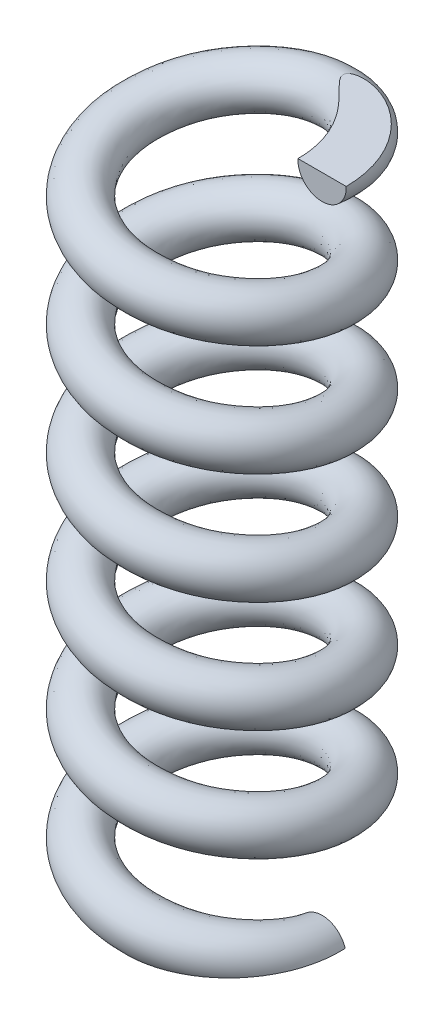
ISO-10303-21;
HEADER;
FILE_DESCRIPTION(('STEP AP214'),'2;1');
FILE_NAME('part.step','',(''),(''),'','','');
FILE_SCHEMA(('AUTOMOTIVE_DESIGN { 1 0 10303 214 1 1 1 1 }'));
ENDSEC;
DATA;
#1=APPLICATION_CONTEXT('core data for automotive mechanical design processes');
#2=APPLICATION_PROTOCOL_DEFINITION('international standard','automotive_design',2000,#1);
#3=PRODUCT_CONTEXT('',#1,'mechanical');
#4=PRODUCT('Part','Part','',(#3));
#5=PRODUCT_RELATED_PRODUCT_CATEGORY('part','',(#4));
#6=PRODUCT_DEFINITION_FORMATION('','',#4);
#7=PRODUCT_DEFINITION_CONTEXT('part definition',#1,'design');
#8=PRODUCT_DEFINITION('design','',#6,#7);
#9=PRODUCT_DEFINITION_SHAPE('','',#8);
#10=(LENGTH_UNIT() NAMED_UNIT(*) SI_UNIT(.MILLI.,.METRE.));
#11=(NAMED_UNIT(*) PLANE_ANGLE_UNIT() SI_UNIT($,.RADIAN.));
#12=(NAMED_UNIT(*) SI_UNIT($,.STERADIAN.) SOLID_ANGLE_UNIT());
#13=UNCERTAINTY_MEASURE_WITH_UNIT(LENGTH_MEASURE(1.E-05),#10,'distance_accuracy_value','');
#14=(GEOMETRIC_REPRESENTATION_CONTEXT(3) GLOBAL_UNCERTAINTY_ASSIGNED_CONTEXT((#13)) GLOBAL_UNIT_ASSIGNED_CONTEXT((#10,
#11,#12)) REPRESENTATION_CONTEXT('',''));
#15=CARTESIAN_POINT('',(0.,0.,0.));
#16=DIRECTION('',(0.,0.,1.));
#17=DIRECTION('',(1.,0.,0.));
#18=AXIS2_PLACEMENT_3D('',#15,#16,#17);
#19=CARTESIAN_POINT('',(15.,36.8486692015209,1.25693328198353E-12));
#20=DIRECTION('',(0.,0.,1.));
#21=DIRECTION('',(1.,0.,0.));
#22=AXIS2_PLACEMENT_3D('',#19,#20,#21);
#23=PLANE('',#22);
#24=CARTESIAN_POINT('',(15.,36.8486692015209,1.25693328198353E-12));
#25=DIRECTION('',(0.,0.,1.));
#26=DIRECTION('',(1.,0.,0.));
#27=AXIS2_PLACEMENT_3D('',#24,#25,#26);
#28=CIRCLE('',#27,3.625);
#29=CARTESIAN_POINT('',(11.3781601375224,37.,9.53439210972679E-13));
#30=VERTEX_POINT('',#29);
#31=CARTESIAN_POINT('',(18.6218398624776,37.,1.56042735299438E-12));
#32=VERTEX_POINT('',#31);
#33=EDGE_CURVE('E80',#30,#32,#28,.T.);
#34=ORIENTED_EDGE('',*,*,#33,.T.);
#35=DIRECTION('',(-1.,0.,0.));
#36=VECTOR('',#35,1.);
#37=CARTESIAN_POINT('',(15.,37.,1.25693328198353E-12));
#38=LINE('',#37,#36);
#39=EDGE_CURVE('E63',#32,#30,#38,.T.);
#40=ORIENTED_EDGE('',*,*,#39,.T.);
#41=EDGE_LOOP('',(#34,#40));
#42=FACE_BOUND('',#41,.T.);
#43=ADVANCED_FACE('F43',(#42),#23,.T.);
#44=CARTESIAN_POINT('',(18.625,36.8486692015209,1.56069215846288E-12));
#45=CARTESIAN_POINT('',(18.6250000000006,35.8080442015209,-7.71472759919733));
#46=CARTESIAN_POINT('',(13.1698637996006,34.7674192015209,-13.1698637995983));
#47=CARTESIAN_POINT('',(7.71472759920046,33.7267942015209,-18.6249999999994));
#48=CARTESIAN_POINT('',(1.56172698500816E-12,32.6861692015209,-18.625));
#49=CARTESIAN_POINT('',(-7.71472759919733,31.6455442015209,-18.6250000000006));
#50=CARTESIAN_POINT('',(-13.1698637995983,30.6049192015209,-13.1698637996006));
#51=CARTESIAN_POINT('',(-18.6249999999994,29.5642942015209,-7.71472759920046));
#52=CARTESIAN_POINT('',(-18.625,28.5236692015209,-1.56297306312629E-12));
#53=CARTESIAN_POINT('',(-18.6250000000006,27.4830442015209,7.71472759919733));
#54=CARTESIAN_POINT('',(-13.1698637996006,26.4424192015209,13.1698637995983));
#55=CARTESIAN_POINT('',(-7.71472759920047,25.4017942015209,18.6249999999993));
#56=CARTESIAN_POINT('',(-1.56420995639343E-12,24.361169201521,18.625));
#57=CARTESIAN_POINT('',(7.71472759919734,23.320544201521,18.6250000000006));
#58=CARTESIAN_POINT('',(13.1698637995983,22.279919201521,13.1698637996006));
#59=CARTESIAN_POINT('',(18.6249999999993,21.239294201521,7.71472759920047));
#60=CARTESIAN_POINT('',(18.625,20.198669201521,1.56069215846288E-12));
#61=CARTESIAN_POINT('',(18.6250000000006,19.158044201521,-7.71472759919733));
#62=CARTESIAN_POINT('',(13.1698637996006,18.117419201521,-13.1698637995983));
#63=CARTESIAN_POINT('',(7.71472759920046,17.076794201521,-18.6249999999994));
#64=CARTESIAN_POINT('',(1.56174535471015E-12,16.036169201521,-18.625));
#65=CARTESIAN_POINT('',(-7.71472759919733,14.995544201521,-18.6250000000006));
#66=CARTESIAN_POINT('',(-13.1698637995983,13.954919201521,-13.1698637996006));
#67=CARTESIAN_POINT('',(-18.6249999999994,12.914294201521,-7.71472759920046));
#68=CARTESIAN_POINT('',(-18.625,11.873669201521,-1.56297306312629E-12));
#69=CARTESIAN_POINT('',(-18.6250000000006,10.833044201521,7.71472759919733));
#70=CARTESIAN_POINT('',(-13.1698637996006,9.79241920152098,13.1698637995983));
#71=CARTESIAN_POINT('',(-7.71472759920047,8.75179420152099,18.6249999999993));
#72=CARTESIAN_POINT('',(-1.56419158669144E-12,7.71116920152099,18.625));
#73=CARTESIAN_POINT('',(7.71472759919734,6.67054420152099,18.6250000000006));
#74=CARTESIAN_POINT('',(13.1698637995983,5.62991920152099,13.1698637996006));
#75=CARTESIAN_POINT('',(18.6249999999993,4.58929420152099,7.71472759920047));
#76=CARTESIAN_POINT('',(18.625,3.548669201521,1.56069215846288E-12));
#77=CARTESIAN_POINT('',(18.6250000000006,2.508044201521,-7.71472759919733));
#78=CARTESIAN_POINT('',(13.1698637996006,1.46741920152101,-13.1698637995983));
#79=CARTESIAN_POINT('',(7.71472759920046,0.426794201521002,-18.6249999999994));
#80=CARTESIAN_POINT('',(1.56176372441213E-12,-0.613830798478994,-18.625));
#81=CARTESIAN_POINT('',(-7.71472759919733,-1.65445579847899,-18.6250000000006));
#82=CARTESIAN_POINT('',(-13.1698637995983,-2.69508079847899,-13.1698637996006));
#83=CARTESIAN_POINT('',(-18.6249999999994,-3.73570579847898,-7.71472759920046));
#84=CARTESIAN_POINT('',(-18.625,-4.77633079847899,-1.56297306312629E-12));
#85=CARTESIAN_POINT('',(-18.6250000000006,-5.81695579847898,7.71472759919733));
#86=CARTESIAN_POINT('',(-13.1698637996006,-6.85758079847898,13.1698637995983));
#87=CARTESIAN_POINT('',(-7.71472759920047,-7.89820579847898,18.6249999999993));
#88=CARTESIAN_POINT('',(-1.56417321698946E-12,-8.93883079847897,18.625));
#89=CARTESIAN_POINT('',(7.71472759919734,-9.97945579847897,18.6250000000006));
#90=CARTESIAN_POINT('',(13.1698637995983,-11.020080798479,13.1698637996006));
#91=CARTESIAN_POINT('',(18.6249999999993,-12.060705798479,7.71472759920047));
#92=CARTESIAN_POINT('',(18.625,-13.101330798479,1.56069215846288E-12));
#93=CARTESIAN_POINT('',(18.6250000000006,-14.141955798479,-7.71472759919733));
#94=CARTESIAN_POINT('',(13.1698637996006,-15.182580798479,-13.1698637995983));
#95=CARTESIAN_POINT('',(7.71472759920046,-16.223205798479,-18.6249999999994));
#96=CARTESIAN_POINT('',(1.56178209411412E-12,-17.263830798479,-18.625));
#97=CARTESIAN_POINT('',(-7.71472759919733,-18.304455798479,-18.6250000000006));
#98=CARTESIAN_POINT('',(-13.1698637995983,-19.3450807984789,-13.1698637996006));
#99=CARTESIAN_POINT('',(-18.6249999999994,-20.3857057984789,-7.71472759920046));
#100=CARTESIAN_POINT('',(-18.625,-21.4263307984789,-1.56297306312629E-12));
#101=CARTESIAN_POINT('',(-18.6250000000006,-22.4669557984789,7.71472759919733));
#102=CARTESIAN_POINT('',(-13.1698637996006,-23.5075807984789,13.1698637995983));
#103=CARTESIAN_POINT('',(-7.71472759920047,-24.5482057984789,18.6249999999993));
#104=CARTESIAN_POINT('',(-1.56415484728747E-12,-25.5888307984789,18.625));
#105=CARTESIAN_POINT('',(7.71472759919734,-26.6294557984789,18.6250000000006));
#106=CARTESIAN_POINT('',(13.1698637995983,-27.6700807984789,13.1698637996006));
#107=CARTESIAN_POINT('',(18.6249999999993,-28.7107057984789,7.71472759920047));
#108=CARTESIAN_POINT('',(18.625,-29.7513307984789,1.56069215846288E-12));
#109=CARTESIAN_POINT('',(18.6250000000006,-30.7919557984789,-7.71472759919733));
#110=CARTESIAN_POINT('',(13.1698637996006,-31.8325807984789,-13.1698637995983));
#111=CARTESIAN_POINT('',(7.71472759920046,-32.8732057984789,-18.6249999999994));
#112=CARTESIAN_POINT('',(1.56180046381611E-12,-33.9138307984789,-18.625));
#113=CARTESIAN_POINT('',(-7.71472759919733,-34.9544557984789,-18.6250000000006));
#114=CARTESIAN_POINT('',(-13.1698637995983,-35.9950807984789,-13.1698637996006));
#115=CARTESIAN_POINT('',(-18.6249999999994,-37.0357057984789,-7.71472759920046));
#116=CARTESIAN_POINT('',(-18.625,-38.0763307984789,-1.56297306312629E-12));
#117=CARTESIAN_POINT('',(-18.6250000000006,-39.1169557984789,7.71472759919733));
#118=CARTESIAN_POINT('',(-13.1698637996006,-40.1575807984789,13.1698637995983));
#119=CARTESIAN_POINT('',(-7.71472759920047,-41.1982057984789,18.6249999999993));
#120=CARTESIAN_POINT('',(-1.56413647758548E-12,-42.2388307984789,18.625));
#121=CARTESIAN_POINT('',(7.71472759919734,-43.2794557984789,18.6250000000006));
#122=CARTESIAN_POINT('',(13.1698637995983,-44.3200807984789,13.1698637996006));
#123=CARTESIAN_POINT('',(18.6249999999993,-45.3607057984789,7.71472759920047));
#124=CARTESIAN_POINT('',(18.625,-46.4013307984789,1.56069215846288E-12));
#125=CARTESIAN_POINT('',(18.6250000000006,-47.4419557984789,-7.71472759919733));
#126=CARTESIAN_POINT('',(13.1698637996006,-48.4825807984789,-13.1698637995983));
#127=CARTESIAN_POINT('',(7.71472759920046,-49.5232057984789,-18.6249999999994));
#128=CARTESIAN_POINT('',(1.5618188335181E-12,-50.5638307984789,-18.625));
#129=CARTESIAN_POINT('',(-7.71472759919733,-51.6044557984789,-18.6250000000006));
#130=CARTESIAN_POINT('',(-13.1698637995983,-52.6450807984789,-13.1698637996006));
#131=CARTESIAN_POINT('',(-18.6249999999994,-53.6857057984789,-7.71472759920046));
#132=CARTESIAN_POINT('',(-18.625,-54.7263307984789,-1.56297306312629E-12));
#133=CARTESIAN_POINT('',(-18.6250000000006,-55.7669557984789,7.71472759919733));
#134=CARTESIAN_POINT('',(-13.1698637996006,-56.8075807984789,13.1698637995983));
#135=CARTESIAN_POINT('',(-7.71472759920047,-57.8482057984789,18.6249999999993));
#136=CARTESIAN_POINT('',(-1.5641181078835E-12,-58.8888307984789,18.625));
#137=CARTESIAN_POINT('',(7.71472759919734,-59.9294557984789,18.6250000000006));
#138=CARTESIAN_POINT('',(13.1698637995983,-60.9700807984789,13.1698637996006));
#139=CARTESIAN_POINT('',(18.6249999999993,-62.0107057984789,7.71472759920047));
#140=CARTESIAN_POINT('',(18.625,-63.0513307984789,1.56069215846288E-12));
#141=CARTESIAN_POINT('',(18.625,44.0986692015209,1.56069215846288E-12));
#142=CARTESIAN_POINT('',(18.6250000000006,43.0580442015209,-7.71472759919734));
#143=CARTESIAN_POINT('',(13.1698637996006,42.0174192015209,-13.1698637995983));
#144=CARTESIAN_POINT('',(7.71472759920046,40.9767942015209,-18.6249999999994));
#145=CARTESIAN_POINT('',(1.56171898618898E-12,39.9361692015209,-18.625));
#146=CARTESIAN_POINT('',(-7.71472759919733,38.8955442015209,-18.6250000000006));
#147=CARTESIAN_POINT('',(-13.1698637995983,37.8549192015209,-13.1698637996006));
#148=CARTESIAN_POINT('',(-18.6249999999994,36.8142942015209,-7.71472759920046));
#149=CARTESIAN_POINT('',(-18.625,35.7736692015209,-1.56297306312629E-12));
#150=CARTESIAN_POINT('',(-18.6250000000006,34.7330442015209,7.71472759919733));
#151=CARTESIAN_POINT('',(-13.1698637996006,33.6924192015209,13.1698637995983));
#152=CARTESIAN_POINT('',(-7.71472759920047,32.6517942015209,18.6249999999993));
#153=CARTESIAN_POINT('',(-1.56421795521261E-12,31.611169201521,18.625));
#154=CARTESIAN_POINT('',(7.71472759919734,30.570544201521,18.6250000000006));
#155=CARTESIAN_POINT('',(13.1698637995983,29.529919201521,13.1698637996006));
#156=CARTESIAN_POINT('',(18.6249999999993,28.489294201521,7.71472759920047));
#157=CARTESIAN_POINT('',(18.625,27.448669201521,1.56069215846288E-12));
#158=CARTESIAN_POINT('',(18.6250000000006,26.408044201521,-7.71472759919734));
#159=CARTESIAN_POINT('',(13.1698637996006,25.367419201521,-13.1698637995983));
#160=CARTESIAN_POINT('',(7.71472759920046,24.326794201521,-18.6249999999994));
#161=CARTESIAN_POINT('',(1.56173735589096E-12,23.286169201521,-18.625));
#162=CARTESIAN_POINT('',(-7.71472759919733,22.245544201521,-18.6250000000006));
#163=CARTESIAN_POINT('',(-13.1698637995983,21.204919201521,-13.1698637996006));
#164=CARTESIAN_POINT('',(-18.6249999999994,20.164294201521,-7.71472759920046));
#165=CARTESIAN_POINT('',(-18.625,19.123669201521,-1.56297306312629E-12));
#166=CARTESIAN_POINT('',(-18.6250000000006,18.083044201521,7.71472759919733));
#167=CARTESIAN_POINT('',(-13.1698637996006,17.042419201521,13.1698637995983));
#168=CARTESIAN_POINT('',(-7.71472759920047,16.001794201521,18.6249999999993));
#169=CARTESIAN_POINT('',(-1.56419958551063E-12,14.961169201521,18.625));
#170=CARTESIAN_POINT('',(7.71472759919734,13.920544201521,18.6250000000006));
#171=CARTESIAN_POINT('',(13.1698637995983,12.879919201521,13.1698637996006));
#172=CARTESIAN_POINT('',(18.6249999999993,11.839294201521,7.71472759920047));
#173=CARTESIAN_POINT('',(18.625,10.798669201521,1.56069215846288E-12));
#174=CARTESIAN_POINT('',(18.6250000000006,9.758044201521,-7.71472759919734));
#175=CARTESIAN_POINT('',(13.1698637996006,8.71741920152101,-13.1698637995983));
#176=CARTESIAN_POINT('',(7.71472759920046,7.676794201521,-18.6249999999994));
#177=CARTESIAN_POINT('',(1.56175572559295E-12,6.63616920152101,-18.625));
#178=CARTESIAN_POINT('',(-7.71472759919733,5.59554420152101,-18.6250000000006));
#179=CARTESIAN_POINT('',(-13.1698637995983,4.55491920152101,-13.1698637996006));
#180=CARTESIAN_POINT('',(-18.6249999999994,3.51429420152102,-7.71472759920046));
#181=CARTESIAN_POINT('',(-18.625,2.47366920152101,-1.56297306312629E-12));
#182=CARTESIAN_POINT('',(-18.6250000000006,1.43304420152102,7.71472759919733));
#183=CARTESIAN_POINT('',(-13.1698637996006,0.39241920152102,13.1698637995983));
#184=CARTESIAN_POINT('',(-7.71472759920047,-0.648205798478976,18.6249999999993));
#185=CARTESIAN_POINT('',(-1.56418121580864E-12,-1.68883079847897,18.625));
#186=CARTESIAN_POINT('',(7.71472759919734,-2.72945579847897,18.6250000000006));
#187=CARTESIAN_POINT('',(13.1698637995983,-3.77008079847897,13.1698637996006));
#188=CARTESIAN_POINT('',(18.6249999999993,-4.81070579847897,7.71472759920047));
#189=CARTESIAN_POINT('',(18.625,-5.85133079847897,1.56069215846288E-12));
#190=CARTESIAN_POINT('',(18.6250000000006,-6.89195579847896,-7.71472759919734));
#191=CARTESIAN_POINT('',(13.1698637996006,-7.93258079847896,-13.1698637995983));
#192=CARTESIAN_POINT('',(7.71472759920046,-8.97320579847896,-18.6249999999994));
#193=CARTESIAN_POINT('',(1.56177409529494E-12,-10.013830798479,-18.625));
#194=CARTESIAN_POINT('',(-7.71472759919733,-11.054455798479,-18.6250000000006));
#195=CARTESIAN_POINT('',(-13.1698637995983,-12.0950807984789,-13.1698637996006));
#196=CARTESIAN_POINT('',(-18.6249999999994,-13.1357057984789,-7.71472759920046));
#197=CARTESIAN_POINT('',(-18.625,-14.1763307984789,-1.56297306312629E-12));
#198=CARTESIAN_POINT('',(-18.6250000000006,-15.2169557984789,7.71472759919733));
#199=CARTESIAN_POINT('',(-13.1698637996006,-16.2575807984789,13.1698637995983));
#200=CARTESIAN_POINT('',(-7.71472759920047,-17.2982057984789,18.6249999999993));
#201=CARTESIAN_POINT('',(-1.56416284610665E-12,-18.3388307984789,18.625));
#202=CARTESIAN_POINT('',(7.71472759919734,-19.3794557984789,18.6250000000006));
#203=CARTESIAN_POINT('',(13.1698637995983,-20.4200807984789,13.1698637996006));
#204=CARTESIAN_POINT('',(18.6249999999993,-21.4607057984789,7.71472759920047));
#205=CARTESIAN_POINT('',(18.625,-22.5013307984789,1.56069215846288E-12));
#206=CARTESIAN_POINT('',(18.6250000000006,-23.5419557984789,-7.71472759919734));
#207=CARTESIAN_POINT('',(13.1698637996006,-24.5825807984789,-13.1698637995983));
#208=CARTESIAN_POINT('',(7.71472759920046,-25.6232057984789,-18.6249999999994));
#209=CARTESIAN_POINT('',(1.56179246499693E-12,-26.6638307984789,-18.625));
#210=CARTESIAN_POINT('',(-7.71472759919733,-27.7044557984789,-18.6250000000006));
#211=CARTESIAN_POINT('',(-13.1698637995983,-28.7450807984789,-13.1698637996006));
#212=CARTESIAN_POINT('',(-18.6249999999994,-29.7857057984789,-7.71472759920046));
#213=CARTESIAN_POINT('',(-18.625,-30.8263307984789,-1.56297306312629E-12));
#214=CARTESIAN_POINT('',(-18.6250000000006,-31.8669557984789,7.71472759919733));
#215=CARTESIAN_POINT('',(-13.1698637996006,-32.9075807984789,13.1698637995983));
#216=CARTESIAN_POINT('',(-7.71472759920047,-33.9482057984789,18.6249999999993));
#217=CARTESIAN_POINT('',(-1.56414447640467E-12,-34.9888307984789,18.625));
#218=CARTESIAN_POINT('',(7.71472759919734,-36.0294557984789,18.6250000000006));
#219=CARTESIAN_POINT('',(13.1698637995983,-37.0700807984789,13.1698637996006));
#220=CARTESIAN_POINT('',(18.6249999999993,-38.1107057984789,7.71472759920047));
#221=CARTESIAN_POINT('',(18.625,-39.1513307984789,1.56069215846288E-12));
#222=CARTESIAN_POINT('',(18.6250000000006,-40.1919557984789,-7.71472759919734));
#223=CARTESIAN_POINT('',(13.1698637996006,-41.2325807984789,-13.1698637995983));
#224=CARTESIAN_POINT('',(7.71472759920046,-42.2732057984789,-18.6249999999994));
#225=CARTESIAN_POINT('',(1.56181083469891E-12,-43.3138307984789,-18.625));
#226=CARTESIAN_POINT('',(-7.71472759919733,-44.3544557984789,-18.6250000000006));
#227=CARTESIAN_POINT('',(-13.1698637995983,-45.3950807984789,-13.1698637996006));
#228=CARTESIAN_POINT('',(-18.6249999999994,-46.4357057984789,-7.71472759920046));
#229=CARTESIAN_POINT('',(-18.625,-47.4763307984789,-1.56297306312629E-12));
#230=CARTESIAN_POINT('',(-18.6250000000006,-48.5169557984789,7.71472759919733));
#231=CARTESIAN_POINT('',(-13.1698637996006,-49.5575807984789,13.1698637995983));
#232=CARTESIAN_POINT('',(-7.71472759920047,-50.5982057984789,18.6249999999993));
#233=CARTESIAN_POINT('',(-1.56412610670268E-12,-51.6388307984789,18.625));
#234=CARTESIAN_POINT('',(7.71472759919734,-52.6794557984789,18.6250000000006));
#235=CARTESIAN_POINT('',(13.1698637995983,-53.7200807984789,13.1698637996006));
#236=CARTESIAN_POINT('',(18.6249999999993,-54.7607057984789,7.71472759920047));
#237=CARTESIAN_POINT('',(18.625,-55.8013307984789,1.56069215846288E-12));
#238=CARTESIAN_POINT('',(11.375,44.0986692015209,9.53174405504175E-13));
#239=CARTESIAN_POINT('',(11.3750000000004,43.0580442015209,-4.711679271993));
#240=CARTESIAN_POINT('',(8.04333963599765,42.0174192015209,-8.0433396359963));
#241=CARTESIAN_POINT('',(4.71167927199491,40.9767942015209,-11.3749999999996));
#242=CARTESIAN_POINT('',(9.5375729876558E-13,39.9361692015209,-11.375));
#243=CARTESIAN_POINT('',(-4.711679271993,38.8955442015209,-11.3750000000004));
#244=CARTESIAN_POINT('',(-8.0433396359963,37.8549192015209,-8.04333963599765));
#245=CARTESIAN_POINT('',(-11.3749999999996,36.8142942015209,-4.71167927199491));
#246=CARTESIAN_POINT('',(-11.375,35.7736692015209,-9.54567441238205E-13));
#247=CARTESIAN_POINT('',(-11.3750000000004,34.7330442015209,4.711679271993));
#248=CARTESIAN_POINT('',(-8.04333963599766,33.6924192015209,8.0433396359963));
#249=CARTESIAN_POINT('',(-4.71167927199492,32.6517942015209,11.3749999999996));
#250=CARTESIAN_POINT('',(-9.55368398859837E-13,31.611169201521,11.375));
#251=CARTESIAN_POINT('',(4.71167927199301,30.570544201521,11.3750000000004));
#252=CARTESIAN_POINT('',(8.0433396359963,29.529919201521,8.04333963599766));
#253=CARTESIAN_POINT('',(11.3749999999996,28.489294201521,4.71167927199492));
#254=CARTESIAN_POINT('',(11.375,27.448669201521,9.53174405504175E-13));
#255=CARTESIAN_POINT('',(11.3750000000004,26.408044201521,-4.711679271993));
#256=CARTESIAN_POINT('',(8.04333963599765,25.367419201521,-8.0433396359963));
#257=CARTESIAN_POINT('',(4.71167927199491,24.326794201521,-11.3749999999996));
#258=CARTESIAN_POINT('',(9.53775668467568E-13,23.286169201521,-11.375));
#259=CARTESIAN_POINT('',(-4.711679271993,22.245544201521,-11.3750000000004));
#260=CARTESIAN_POINT('',(-8.0433396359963,21.204919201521,-8.04333963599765));
#261=CARTESIAN_POINT('',(-11.3749999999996,20.164294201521,-4.71167927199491));
#262=CARTESIAN_POINT('',(-11.375,19.123669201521,-9.54567441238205E-13));
#263=CARTESIAN_POINT('',(-11.3750000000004,18.083044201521,4.711679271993));
#264=CARTESIAN_POINT('',(-8.04333963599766,17.042419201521,8.0433396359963));
#265=CARTESIAN_POINT('',(-4.71167927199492,16.001794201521,11.3749999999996));
#266=CARTESIAN_POINT('',(-9.5535002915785E-13,14.961169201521,11.375));
#267=CARTESIAN_POINT('',(4.71167927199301,13.920544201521,11.3750000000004));
#268=CARTESIAN_POINT('',(8.0433396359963,12.879919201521,8.04333963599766));
#269=CARTESIAN_POINT('',(11.3749999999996,11.839294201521,4.71167927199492));
#270=CARTESIAN_POINT('',(11.375,10.798669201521,9.53174405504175E-13));
#271=CARTESIAN_POINT('',(11.3750000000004,9.758044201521,-4.711679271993));
#272=CARTESIAN_POINT('',(8.04333963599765,8.71741920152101,-8.0433396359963));
#273=CARTESIAN_POINT('',(4.71167927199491,7.676794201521,-11.3749999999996));
#274=CARTESIAN_POINT('',(9.53794038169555E-13,6.63616920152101,-11.375));
#275=CARTESIAN_POINT('',(-4.711679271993,5.59554420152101,-11.3750000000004));
#276=CARTESIAN_POINT('',(-8.0433396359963,4.55491920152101,-8.04333963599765));
#277=CARTESIAN_POINT('',(-11.3749999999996,3.51429420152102,-4.71167927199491));
#278=CARTESIAN_POINT('',(-11.375,2.47366920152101,-9.54567441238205E-13));
#279=CARTESIAN_POINT('',(-11.3750000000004,1.43304420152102,4.711679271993));
#280=CARTESIAN_POINT('',(-8.04333963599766,0.39241920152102,8.0433396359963));
#281=CARTESIAN_POINT('',(-4.71167927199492,-0.648205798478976,11.3749999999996));
#282=CARTESIAN_POINT('',(-9.55331659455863E-13,-1.68883079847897,11.375));
#283=CARTESIAN_POINT('',(4.71167927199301,-2.72945579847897,11.3750000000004));
#284=CARTESIAN_POINT('',(8.0433396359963,-3.77008079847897,8.04333963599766));
#285=CARTESIAN_POINT('',(11.3749999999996,-4.81070579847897,4.71167927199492));
#286=CARTESIAN_POINT('',(11.375,-5.85133079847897,9.53174405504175E-13));
#287=CARTESIAN_POINT('',(11.3750000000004,-6.89195579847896,-4.711679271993));
#288=CARTESIAN_POINT('',(8.04333963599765,-7.93258079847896,-8.0433396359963));
#289=CARTESIAN_POINT('',(4.71167927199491,-8.97320579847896,-11.3749999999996));
#290=CARTESIAN_POINT('',(9.53812407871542E-13,-10.013830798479,-11.375));
#291=CARTESIAN_POINT('',(-4.711679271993,-11.054455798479,-11.3750000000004));
#292=CARTESIAN_POINT('',(-8.0433396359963,-12.0950807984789,-8.04333963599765));
#293=CARTESIAN_POINT('',(-11.3749999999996,-13.1357057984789,-4.71167927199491));
#294=CARTESIAN_POINT('',(-11.375,-14.1763307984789,-9.54567441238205E-13));
#295=CARTESIAN_POINT('',(-11.3750000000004,-15.2169557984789,4.711679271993));
#296=CARTESIAN_POINT('',(-8.04333963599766,-16.2575807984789,8.0433396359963));
#297=CARTESIAN_POINT('',(-4.71167927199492,-17.2982057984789,11.3749999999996));
#298=CARTESIAN_POINT('',(-9.55313289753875E-13,-18.3388307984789,11.375));
#299=CARTESIAN_POINT('',(4.71167927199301,-19.3794557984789,11.3750000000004));
#300=CARTESIAN_POINT('',(8.0433396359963,-20.4200807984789,8.04333963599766));
#301=CARTESIAN_POINT('',(11.3749999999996,-21.4607057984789,4.71167927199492));
#302=CARTESIAN_POINT('',(11.375,-22.5013307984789,9.53174405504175E-13));
#303=CARTESIAN_POINT('',(11.3750000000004,-23.5419557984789,-4.711679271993));
#304=CARTESIAN_POINT('',(8.04333963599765,-24.5825807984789,-8.0433396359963));
#305=CARTESIAN_POINT('',(4.71167927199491,-25.6232057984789,-11.3749999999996));
#306=CARTESIAN_POINT('',(9.53830777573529E-13,-26.6638307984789,-11.375));
#307=CARTESIAN_POINT('',(-4.711679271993,-27.7044557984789,-11.3750000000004));
#308=CARTESIAN_POINT('',(-8.0433396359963,-28.7450807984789,-8.04333963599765));
#309=CARTESIAN_POINT('',(-11.3749999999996,-29.7857057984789,-4.71167927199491));
#310=CARTESIAN_POINT('',(-11.375,-30.8263307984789,-9.54567441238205E-13));
#311=CARTESIAN_POINT('',(-11.3750000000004,-31.8669557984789,4.711679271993));
#312=CARTESIAN_POINT('',(-8.04333963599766,-32.9075807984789,8.0433396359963));
#313=CARTESIAN_POINT('',(-4.71167927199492,-33.9482057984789,11.3749999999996));
#314=CARTESIAN_POINT('',(-9.55294920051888E-13,-34.9888307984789,11.375));
#315=CARTESIAN_POINT('',(4.71167927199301,-36.0294557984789,11.3750000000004));
#316=CARTESIAN_POINT('',(8.0433396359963,-37.0700807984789,8.04333963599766));
#317=CARTESIAN_POINT('',(11.3749999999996,-38.1107057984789,4.71167927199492));
#318=CARTESIAN_POINT('',(11.375,-39.1513307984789,9.53174405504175E-13));
#319=CARTESIAN_POINT('',(11.3750000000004,-40.1919557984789,-4.711679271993));
#320=CARTESIAN_POINT('',(8.04333963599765,-41.2325807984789,-8.0433396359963));
#321=CARTESIAN_POINT('',(4.71167927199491,-42.2732057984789,-11.3749999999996));
#322=CARTESIAN_POINT('',(9.53849147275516E-13,-43.3138307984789,-11.375));
#323=CARTESIAN_POINT('',(-4.711679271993,-44.3544557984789,-11.3750000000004));
#324=CARTESIAN_POINT('',(-8.0433396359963,-45.3950807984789,-8.04333963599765));
#325=CARTESIAN_POINT('',(-11.3749999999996,-46.4357057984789,-4.71167927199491));
#326=CARTESIAN_POINT('',(-11.375,-47.4763307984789,-9.54567441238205E-13));
#327=CARTESIAN_POINT('',(-11.3750000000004,-48.5169557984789,4.711679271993));
#328=CARTESIAN_POINT('',(-8.04333963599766,-49.5575807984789,8.0433396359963));
#329=CARTESIAN_POINT('',(-4.71167927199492,-50.5982057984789,11.3749999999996));
#330=CARTESIAN_POINT('',(-9.55276550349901E-13,-51.6388307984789,11.375));
#331=CARTESIAN_POINT('',(4.71167927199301,-52.6794557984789,11.3750000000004));
#332=CARTESIAN_POINT('',(8.0433396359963,-53.7200807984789,8.04333963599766));
#333=CARTESIAN_POINT('',(11.3749999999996,-54.7607057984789,4.71167927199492));
#334=CARTESIAN_POINT('',(11.375,-55.8013307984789,9.53174405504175E-13));
#335=CARTESIAN_POINT('',(11.375,36.8486692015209,9.53174405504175E-13));
#336=CARTESIAN_POINT('',(11.3750000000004,35.8080442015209,-4.711679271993));
#337=CARTESIAN_POINT('',(8.04333963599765,34.7674192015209,-8.0433396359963));
#338=CARTESIAN_POINT('',(4.71167927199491,33.7267942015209,-11.3749999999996));
#339=CARTESIAN_POINT('',(9.53765297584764E-13,32.6861692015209,-11.375));
#340=CARTESIAN_POINT('',(-4.711679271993,31.6455442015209,-11.3750000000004));
#341=CARTESIAN_POINT('',(-8.0433396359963,30.6049192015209,-8.04333963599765));
#342=CARTESIAN_POINT('',(-11.3749999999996,29.5642942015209,-4.71167927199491));
#343=CARTESIAN_POINT('',(-11.375,28.5236692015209,-9.54567441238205E-13));
#344=CARTESIAN_POINT('',(-11.3750000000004,27.4830442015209,4.711679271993));
#345=CARTESIAN_POINT('',(-8.04333963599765,26.4424192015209,8.0433396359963));
#346=CARTESIAN_POINT('',(-4.71167927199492,25.4017942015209,11.3749999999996));
#347=CARTESIAN_POINT('',(-9.55360400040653E-13,24.361169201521,11.375));
#348=CARTESIAN_POINT('',(4.71167927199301,23.320544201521,11.3750000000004));
#349=CARTESIAN_POINT('',(8.0433396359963,22.279919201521,8.04333963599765));
#350=CARTESIAN_POINT('',(11.3749999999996,21.239294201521,4.71167927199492));
#351=CARTESIAN_POINT('',(11.375,20.198669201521,9.53174405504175E-13));
#352=CARTESIAN_POINT('',(11.3750000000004,19.158044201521,-4.711679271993));
#353=CARTESIAN_POINT('',(8.04333963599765,18.117419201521,-8.0433396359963));
#354=CARTESIAN_POINT('',(4.71167927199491,17.076794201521,-11.3749999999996));
#355=CARTESIAN_POINT('',(9.53783667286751E-13,16.036169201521,-11.375));
#356=CARTESIAN_POINT('',(-4.711679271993,14.995544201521,-11.3750000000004));
#357=CARTESIAN_POINT('',(-8.0433396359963,13.954919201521,-8.04333963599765));
#358=CARTESIAN_POINT('',(-11.3749999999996,12.914294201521,-4.71167927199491));
#359=CARTESIAN_POINT('',(-11.375,11.873669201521,-9.54567441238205E-13));
#360=CARTESIAN_POINT('',(-11.3750000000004,10.833044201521,4.711679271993));
#361=CARTESIAN_POINT('',(-8.04333963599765,9.79241920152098,8.0433396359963));
#362=CARTESIAN_POINT('',(-4.71167927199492,8.75179420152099,11.3749999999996));
#363=CARTESIAN_POINT('',(-9.55342030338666E-13,7.71116920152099,11.375));
#364=CARTESIAN_POINT('',(4.71167927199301,6.67054420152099,11.3750000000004));
#365=CARTESIAN_POINT('',(8.0433396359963,5.62991920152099,8.04333963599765));
#366=CARTESIAN_POINT('',(11.3749999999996,4.58929420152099,4.71167927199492));
#367=CARTESIAN_POINT('',(11.375,3.548669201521,9.53174405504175E-13));
#368=CARTESIAN_POINT('',(11.3750000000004,2.508044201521,-4.711679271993));
#369=CARTESIAN_POINT('',(8.04333963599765,1.46741920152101,-8.0433396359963));
#370=CARTESIAN_POINT('',(4.71167927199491,0.426794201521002,-11.3749999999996));
#371=CARTESIAN_POINT('',(9.53802036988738E-13,-0.613830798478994,-11.375));
#372=CARTESIAN_POINT('',(-4.711679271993,-1.65445579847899,-11.3750000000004));
#373=CARTESIAN_POINT('',(-8.0433396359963,-2.69508079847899,-8.04333963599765));
#374=CARTESIAN_POINT('',(-11.3749999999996,-3.73570579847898,-4.71167927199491));
#375=CARTESIAN_POINT('',(-11.375,-4.77633079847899,-9.54567441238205E-13));
#376=CARTESIAN_POINT('',(-11.3750000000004,-5.81695579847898,4.711679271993));
#377=CARTESIAN_POINT('',(-8.04333963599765,-6.85758079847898,8.0433396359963));
#378=CARTESIAN_POINT('',(-4.71167927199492,-7.89820579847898,11.3749999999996));
#379=CARTESIAN_POINT('',(-9.55323660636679E-13,-8.93883079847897,11.375));
#380=CARTESIAN_POINT('',(4.71167927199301,-9.97945579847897,11.3750000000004));
#381=CARTESIAN_POINT('',(8.0433396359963,-11.020080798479,8.04333963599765));
#382=CARTESIAN_POINT('',(11.3749999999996,-12.060705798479,4.71167927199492));
#383=CARTESIAN_POINT('',(11.375,-13.101330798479,9.53174405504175E-13));
#384=CARTESIAN_POINT('',(11.3750000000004,-14.141955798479,-4.711679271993));
#385=CARTESIAN_POINT('',(8.04333963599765,-15.182580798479,-8.0433396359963));
#386=CARTESIAN_POINT('',(4.71167927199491,-16.223205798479,-11.3749999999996));
#387=CARTESIAN_POINT('',(9.53820406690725E-13,-17.263830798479,-11.375));
#388=CARTESIAN_POINT('',(-4.711679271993,-18.304455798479,-11.3750000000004));
#389=CARTESIAN_POINT('',(-8.0433396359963,-19.3450807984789,-8.04333963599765));
#390=CARTESIAN_POINT('',(-11.3749999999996,-20.3857057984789,-4.71167927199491));
#391=CARTESIAN_POINT('',(-11.375,-21.4263307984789,-9.54567441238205E-13));
#392=CARTESIAN_POINT('',(-11.3750000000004,-22.4669557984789,4.711679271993));
#393=CARTESIAN_POINT('',(-8.04333963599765,-23.5075807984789,8.0433396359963));
#394=CARTESIAN_POINT('',(-4.71167927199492,-24.5482057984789,11.3749999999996));
#395=CARTESIAN_POINT('',(-9.55305290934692E-13,-25.5888307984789,11.375));
#396=CARTESIAN_POINT('',(4.71167927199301,-26.6294557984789,11.3750000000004));
#397=CARTESIAN_POINT('',(8.0433396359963,-27.6700807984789,8.04333963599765));
#398=CARTESIAN_POINT('',(11.3749999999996,-28.7107057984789,4.71167927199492));
#399=CARTESIAN_POINT('',(11.375,-29.7513307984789,9.53174405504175E-13));
#400=CARTESIAN_POINT('',(11.3750000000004,-30.7919557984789,-4.711679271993));
#401=CARTESIAN_POINT('',(8.04333963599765,-31.8325807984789,-8.0433396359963));
#402=CARTESIAN_POINT('',(4.71167927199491,-32.8732057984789,-11.3749999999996));
#403=CARTESIAN_POINT('',(9.53838776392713E-13,-33.9138307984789,-11.375));
#404=CARTESIAN_POINT('',(-4.711679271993,-34.9544557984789,-11.3750000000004));
#405=CARTESIAN_POINT('',(-8.0433396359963,-35.9950807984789,-8.04333963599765));
#406=CARTESIAN_POINT('',(-11.3749999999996,-37.0357057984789,-4.71167927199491));
#407=CARTESIAN_POINT('',(-11.375,-38.0763307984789,-9.54567441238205E-13));
#408=CARTESIAN_POINT('',(-11.3750000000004,-39.1169557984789,4.711679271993));
#409=CARTESIAN_POINT('',(-8.04333963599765,-40.1575807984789,8.0433396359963));
#410=CARTESIAN_POINT('',(-4.71167927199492,-41.1982057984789,11.3749999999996));
#411=CARTESIAN_POINT('',(-9.55286921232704E-13,-42.2388307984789,11.375));
#412=CARTESIAN_POINT('',(4.71167927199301,-43.2794557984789,11.3750000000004));
#413=CARTESIAN_POINT('',(8.0433396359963,-44.3200807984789,8.04333963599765));
#414=CARTESIAN_POINT('',(11.3749999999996,-45.3607057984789,4.71167927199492));
#415=CARTESIAN_POINT('',(11.375,-46.4013307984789,9.53174405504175E-13));
#416=CARTESIAN_POINT('',(11.3750000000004,-47.4419557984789,-4.711679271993));
#417=CARTESIAN_POINT('',(8.04333963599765,-48.4825807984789,-8.0433396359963));
#418=CARTESIAN_POINT('',(4.71167927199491,-49.5232057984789,-11.3749999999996));
#419=CARTESIAN_POINT('',(9.538571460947E-13,-50.5638307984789,-11.375));
#420=CARTESIAN_POINT('',(-4.711679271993,-51.6044557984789,-11.3750000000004));
#421=CARTESIAN_POINT('',(-8.0433396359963,-52.6450807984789,-8.04333963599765));
#422=CARTESIAN_POINT('',(-11.3749999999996,-53.6857057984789,-4.71167927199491));
#423=CARTESIAN_POINT('',(-11.375,-54.7263307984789,-9.54567441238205E-13));
#424=CARTESIAN_POINT('',(-11.3750000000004,-55.7669557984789,4.711679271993));
#425=CARTESIAN_POINT('',(-8.04333963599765,-56.8075807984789,8.0433396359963));
#426=CARTESIAN_POINT('',(-4.71167927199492,-57.8482057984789,11.3749999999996));
#427=CARTESIAN_POINT('',(-9.55268551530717E-13,-58.8888307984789,11.375));
#428=CARTESIAN_POINT('',(4.71167927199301,-59.9294557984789,11.3750000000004));
#429=CARTESIAN_POINT('',(8.0433396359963,-60.9700807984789,8.04333963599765));
#430=CARTESIAN_POINT('',(11.3749999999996,-62.0107057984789,4.71167927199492));
#431=CARTESIAN_POINT('',(11.375,-63.0513307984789,9.53174405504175E-13));
#432=CARTESIAN_POINT('',(11.375,29.5986692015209,9.53174405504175E-13));
#433=CARTESIAN_POINT('',(11.3750000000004,28.5580442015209,-4.711679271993));
#434=CARTESIAN_POINT('',(8.04333963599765,27.5174192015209,-8.0433396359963));
#435=CARTESIAN_POINT('',(4.71167927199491,26.4767942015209,-11.3749999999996));
#436=CARTESIAN_POINT('',(9.53773296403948E-13,25.4361692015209,-11.375));
#437=CARTESIAN_POINT('',(-4.711679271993,24.3955442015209,-11.3750000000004));
#438=CARTESIAN_POINT('',(-8.0433396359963,23.3549192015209,-8.04333963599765));
#439=CARTESIAN_POINT('',(-11.3749999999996,22.3142942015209,-4.71167927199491));
#440=CARTESIAN_POINT('',(-11.375,21.2736692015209,-9.54567441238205E-13));
#441=CARTESIAN_POINT('',(-11.3750000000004,20.233044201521,4.711679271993));
#442=CARTESIAN_POINT('',(-8.04333963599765,19.192419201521,8.0433396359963));
#443=CARTESIAN_POINT('',(-4.71167927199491,18.151794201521,11.3749999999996));
#444=CARTESIAN_POINT('',(-9.5535240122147E-13,17.111169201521,11.375));
#445=CARTESIAN_POINT('',(4.71167927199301,16.070544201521,11.3750000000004));
#446=CARTESIAN_POINT('',(8.0433396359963,15.029919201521,8.04333963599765));
#447=CARTESIAN_POINT('',(11.3749999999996,13.989294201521,4.71167927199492));
#448=CARTESIAN_POINT('',(11.375,12.948669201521,9.53174405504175E-13));
#449=CARTESIAN_POINT('',(11.3750000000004,11.908044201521,-4.711679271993));
#450=CARTESIAN_POINT('',(8.04333963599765,10.867419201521,-8.0433396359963));
#451=CARTESIAN_POINT('',(4.71167927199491,9.82679420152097,-11.3749999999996));
#452=CARTESIAN_POINT('',(9.53791666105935E-13,8.78616920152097,-11.375));
#453=CARTESIAN_POINT('',(-4.711679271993,7.74554420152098,-11.3750000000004));
#454=CARTESIAN_POINT('',(-8.0433396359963,6.70491920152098,-8.04333963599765));
#455=CARTESIAN_POINT('',(-11.3749999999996,5.66429420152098,-4.71167927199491));
#456=CARTESIAN_POINT('',(-11.375,4.62366920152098,-9.54567441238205E-13));
#457=CARTESIAN_POINT('',(-11.3750000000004,3.58304420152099,4.711679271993));
#458=CARTESIAN_POINT('',(-8.04333963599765,2.54241920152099,8.0433396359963));
#459=CARTESIAN_POINT('',(-4.71167927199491,1.50179420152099,11.3749999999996));
#460=CARTESIAN_POINT('',(-9.55334031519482E-13,0.461169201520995,11.375));
#461=CARTESIAN_POINT('',(4.71167927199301,-0.579455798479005,11.3750000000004));
#462=CARTESIAN_POINT('',(8.0433396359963,-1.620080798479,8.04333963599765));
#463=CARTESIAN_POINT('',(11.3749999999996,-2.660705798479,4.71167927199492));
#464=CARTESIAN_POINT('',(11.375,-3.701330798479,9.53174405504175E-13));
#465=CARTESIAN_POINT('',(11.3750000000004,-4.74195579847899,-4.711679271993));
#466=CARTESIAN_POINT('',(8.04333963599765,-5.78258079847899,-8.0433396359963));
#467=CARTESIAN_POINT('',(4.71167927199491,-6.82320579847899,-11.3749999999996));
#468=CARTESIAN_POINT('',(9.53810035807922E-13,-7.86383079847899,-11.375));
#469=CARTESIAN_POINT('',(-4.711679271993,-8.90445579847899,-11.3750000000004));
#470=CARTESIAN_POINT('',(-8.0433396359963,-9.94508079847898,-8.04333963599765));
#471=CARTESIAN_POINT('',(-11.3749999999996,-10.985705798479,-4.71167927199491));
#472=CARTESIAN_POINT('',(-11.375,-12.026330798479,-9.54567441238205E-13));
#473=CARTESIAN_POINT('',(-11.3750000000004,-13.066955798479,4.711679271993));
#474=CARTESIAN_POINT('',(-8.04333963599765,-14.107580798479,8.0433396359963));
#475=CARTESIAN_POINT('',(-4.71167927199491,-15.148205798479,11.3749999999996));
#476=CARTESIAN_POINT('',(-9.55315661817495E-13,-16.188830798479,11.375));
#477=CARTESIAN_POINT('',(4.71167927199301,-17.229455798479,11.3750000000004));
#478=CARTESIAN_POINT('',(8.0433396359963,-18.270080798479,8.04333963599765));
#479=CARTESIAN_POINT('',(11.3749999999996,-19.310705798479,4.71167927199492));
#480=CARTESIAN_POINT('',(11.375,-20.351330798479,9.53174405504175E-13));
#481=CARTESIAN_POINT('',(11.3750000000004,-21.391955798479,-4.711679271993));
#482=CARTESIAN_POINT('',(8.04333963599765,-22.432580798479,-8.0433396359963));
#483=CARTESIAN_POINT('',(4.71167927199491,-23.473205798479,-11.3749999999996));
#484=CARTESIAN_POINT('',(9.53828405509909E-13,-24.513830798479,-11.375));
#485=CARTESIAN_POINT('',(-4.711679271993,-25.554455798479,-11.3750000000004));
#486=CARTESIAN_POINT('',(-8.0433396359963,-26.5950807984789,-8.04333963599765));
#487=CARTESIAN_POINT('',(-11.3749999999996,-27.6357057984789,-4.71167927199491));
#488=CARTESIAN_POINT('',(-11.375,-28.6763307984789,-9.54567441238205E-13));
#489=CARTESIAN_POINT('',(-11.3750000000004,-29.7169557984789,4.711679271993));
#490=CARTESIAN_POINT('',(-8.04333963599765,-30.7575807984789,8.0433396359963));
#491=CARTESIAN_POINT('',(-4.71167927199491,-31.7982057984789,11.3749999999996));
#492=CARTESIAN_POINT('',(-9.55297292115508E-13,-32.8388307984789,11.375));
#493=CARTESIAN_POINT('',(4.71167927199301,-33.8794557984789,11.3750000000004));
#494=CARTESIAN_POINT('',(8.0433396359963,-34.9200807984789,8.04333963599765));
#495=CARTESIAN_POINT('',(11.3749999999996,-35.9607057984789,4.71167927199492));
#496=CARTESIAN_POINT('',(11.375,-37.0013307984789,9.53174405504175E-13));
#497=CARTESIAN_POINT('',(11.3750000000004,-38.0419557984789,-4.711679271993));
#498=CARTESIAN_POINT('',(8.04333963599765,-39.0825807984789,-8.0433396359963));
#499=CARTESIAN_POINT('',(4.71167927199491,-40.1232057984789,-11.3749999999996));
#500=CARTESIAN_POINT('',(9.53846775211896E-13,-41.1638307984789,-11.375));
#501=CARTESIAN_POINT('',(-4.711679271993,-42.2044557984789,-11.3750000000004));
#502=CARTESIAN_POINT('',(-8.0433396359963,-43.2450807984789,-8.04333963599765));
#503=CARTESIAN_POINT('',(-11.3749999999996,-44.2857057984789,-4.71167927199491));
#504=CARTESIAN_POINT('',(-11.375,-45.3263307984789,-9.54567441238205E-13));
#505=CARTESIAN_POINT('',(-11.3750000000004,-46.3669557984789,4.711679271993));
#506=CARTESIAN_POINT('',(-8.04333963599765,-47.4075807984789,8.0433396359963));
#507=CARTESIAN_POINT('',(-4.71167927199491,-48.4482057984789,11.3749999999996));
#508=CARTESIAN_POINT('',(-9.55278922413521E-13,-49.4888307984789,11.375));
#509=CARTESIAN_POINT('',(4.71167927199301,-50.5294557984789,11.3750000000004));
#510=CARTESIAN_POINT('',(8.0433396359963,-51.5700807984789,8.04333963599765));
#511=CARTESIAN_POINT('',(11.3749999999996,-52.6107057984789,4.71167927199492));
#512=CARTESIAN_POINT('',(11.375,-53.6513307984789,9.53174405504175E-13));
#513=CARTESIAN_POINT('',(11.3750000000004,-54.6919557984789,-4.711679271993));
#514=CARTESIAN_POINT('',(8.04333963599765,-55.7325807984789,-8.0433396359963));
#515=CARTESIAN_POINT('',(4.71167927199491,-56.7732057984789,-11.3749999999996));
#516=CARTESIAN_POINT('',(9.53865144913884E-13,-57.8138307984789,-11.375));
#517=CARTESIAN_POINT('',(-4.711679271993,-58.8544557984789,-11.3750000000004));
#518=CARTESIAN_POINT('',(-8.0433396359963,-59.8950807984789,-8.04333963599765));
#519=CARTESIAN_POINT('',(-11.3749999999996,-60.9357057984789,-4.71167927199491));
#520=CARTESIAN_POINT('',(-11.375,-61.9763307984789,-9.54567441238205E-13));
#521=CARTESIAN_POINT('',(-11.3750000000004,-63.0169557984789,4.711679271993));
#522=CARTESIAN_POINT('',(-8.04333963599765,-64.0575807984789,8.0433396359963));
#523=CARTESIAN_POINT('',(-4.71167927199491,-65.0982057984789,11.3749999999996));
#524=CARTESIAN_POINT('',(-9.55260552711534E-13,-66.1388307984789,11.375));
#525=CARTESIAN_POINT('',(4.71167927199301,-67.1794557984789,11.3750000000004));
#526=CARTESIAN_POINT('',(8.0433396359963,-68.2200807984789,8.04333963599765));
#527=CARTESIAN_POINT('',(11.3749999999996,-69.2607057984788,4.71167927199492));
#528=CARTESIAN_POINT('',(11.375,-70.3013307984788,9.53174405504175E-13));
#529=CARTESIAN_POINT('',(18.625,29.5986692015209,1.56069215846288E-12));
#530=CARTESIAN_POINT('',(18.6250000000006,28.5580442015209,-7.71472759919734));
#531=CARTESIAN_POINT('',(13.1698637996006,27.5174192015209,-13.1698637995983));
#532=CARTESIAN_POINT('',(7.71472759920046,26.4767942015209,-18.6249999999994));
#533=CARTESIAN_POINT('',(1.56173498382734E-12,25.4361692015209,-18.625));
#534=CARTESIAN_POINT('',(-7.71472759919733,24.3955442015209,-18.6250000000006));
#535=CARTESIAN_POINT('',(-13.1698637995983,23.3549192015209,-13.1698637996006));
#536=CARTESIAN_POINT('',(-18.6249999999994,22.3142942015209,-7.71472759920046));
#537=CARTESIAN_POINT('',(-18.625,21.2736692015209,-1.56297306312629E-12));
#538=CARTESIAN_POINT('',(-18.6250000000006,20.233044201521,7.71472759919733));
#539=CARTESIAN_POINT('',(-13.1698637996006,19.192419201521,13.1698637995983));
#540=CARTESIAN_POINT('',(-7.71472759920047,18.151794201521,18.6249999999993));
#541=CARTESIAN_POINT('',(-1.56420195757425E-12,17.111169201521,18.625));
#542=CARTESIAN_POINT('',(7.71472759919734,16.070544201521,18.6250000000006));
#543=CARTESIAN_POINT('',(13.1698637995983,15.029919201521,13.1698637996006));
#544=CARTESIAN_POINT('',(18.6249999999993,13.989294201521,7.71472759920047));
#545=CARTESIAN_POINT('',(18.625,12.948669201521,1.56069215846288E-12));
#546=CARTESIAN_POINT('',(18.6250000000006,11.908044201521,-7.71472759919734));
#547=CARTESIAN_POINT('',(13.1698637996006,10.867419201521,-13.1698637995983));
#548=CARTESIAN_POINT('',(7.71472759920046,9.82679420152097,-18.6249999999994));
#549=CARTESIAN_POINT('',(1.56175335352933E-12,8.78616920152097,-18.625));
#550=CARTESIAN_POINT('',(-7.71472759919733,7.74554420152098,-18.6250000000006));
#551=CARTESIAN_POINT('',(-13.1698637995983,6.70491920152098,-13.1698637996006));
#552=CARTESIAN_POINT('',(-18.6249999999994,5.66429420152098,-7.71472759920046));
#553=CARTESIAN_POINT('',(-18.625,4.62366920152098,-1.56297306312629E-12));
#554=CARTESIAN_POINT('',(-18.6250000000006,3.58304420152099,7.71472759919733));
#555=CARTESIAN_POINT('',(-13.1698637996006,2.54241920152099,13.1698637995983));
#556=CARTESIAN_POINT('',(-7.71472759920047,1.50179420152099,18.6249999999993));
#557=CARTESIAN_POINT('',(-1.56418358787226E-12,0.461169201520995,18.625));
#558=CARTESIAN_POINT('',(7.71472759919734,-0.579455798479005,18.6250000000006));
#559=CARTESIAN_POINT('',(13.1698637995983,-1.620080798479,13.1698637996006));
#560=CARTESIAN_POINT('',(18.6249999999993,-2.660705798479,7.71472759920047));
#561=CARTESIAN_POINT('',(18.625,-3.701330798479,1.56069215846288E-12));
#562=CARTESIAN_POINT('',(18.6250000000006,-4.74195579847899,-7.71472759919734));
#563=CARTESIAN_POINT('',(13.1698637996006,-5.78258079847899,-13.1698637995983));
#564=CARTESIAN_POINT('',(7.71472759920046,-6.82320579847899,-18.6249999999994));
#565=CARTESIAN_POINT('',(1.56177172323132E-12,-7.86383079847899,-18.625));
#566=CARTESIAN_POINT('',(-7.71472759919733,-8.90445579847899,-18.6250000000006));
#567=CARTESIAN_POINT('',(-13.1698637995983,-9.94508079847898,-13.1698637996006));
#568=CARTESIAN_POINT('',(-18.6249999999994,-10.985705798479,-7.71472759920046));
#569=CARTESIAN_POINT('',(-18.625,-12.026330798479,-1.56297306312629E-12));
#570=CARTESIAN_POINT('',(-18.6250000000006,-13.066955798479,7.71472759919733));
#571=CARTESIAN_POINT('',(-13.1698637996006,-14.107580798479,13.1698637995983));
#572=CARTESIAN_POINT('',(-7.71472759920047,-15.148205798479,18.6249999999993));
#573=CARTESIAN_POINT('',(-1.56416521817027E-12,-16.188830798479,18.625));
#574=CARTESIAN_POINT('',(7.71472759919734,-17.229455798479,18.6250000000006));
#575=CARTESIAN_POINT('',(13.1698637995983,-18.270080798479,13.1698637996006));
#576=CARTESIAN_POINT('',(18.6249999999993,-19.310705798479,7.71472759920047));
#577=CARTESIAN_POINT('',(18.625,-20.351330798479,1.56069215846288E-12));
#578=CARTESIAN_POINT('',(18.6250000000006,-21.391955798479,-7.71472759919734));
#579=CARTESIAN_POINT('',(13.1698637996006,-22.432580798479,-13.1698637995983));
#580=CARTESIAN_POINT('',(7.71472759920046,-23.473205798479,-18.6249999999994));
#581=CARTESIAN_POINT('',(1.56179009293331E-12,-24.513830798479,-18.625));
#582=CARTESIAN_POINT('',(-7.71472759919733,-25.554455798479,-18.6250000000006));
#583=CARTESIAN_POINT('',(-13.1698637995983,-26.5950807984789,-13.1698637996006));
#584=CARTESIAN_POINT('',(-18.6249999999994,-27.6357057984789,-7.71472759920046));
#585=CARTESIAN_POINT('',(-18.625,-28.6763307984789,-1.56297306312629E-12));
#586=CARTESIAN_POINT('',(-18.6250000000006,-29.7169557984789,7.71472759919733));
#587=CARTESIAN_POINT('',(-13.1698637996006,-30.7575807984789,13.1698637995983));
#588=CARTESIAN_POINT('',(-7.71472759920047,-31.7982057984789,18.6249999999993));
#589=CARTESIAN_POINT('',(-1.56414684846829E-12,-32.8388307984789,18.625));
#590=CARTESIAN_POINT('',(7.71472759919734,-33.8794557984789,18.6250000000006));
#591=CARTESIAN_POINT('',(13.1698637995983,-34.9200807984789,13.1698637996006));
#592=CARTESIAN_POINT('',(18.6249999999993,-35.9607057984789,7.71472759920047));
#593=CARTESIAN_POINT('',(18.625,-37.0013307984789,1.56069215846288E-12));
#594=CARTESIAN_POINT('',(18.6250000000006,-38.0419557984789,-7.71472759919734));
#595=CARTESIAN_POINT('',(13.1698637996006,-39.0825807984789,-13.1698637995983));
#596=CARTESIAN_POINT('',(7.71472759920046,-40.1232057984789,-18.6249999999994));
#597=CARTESIAN_POINT('',(1.56180846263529E-12,-41.1638307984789,-18.625));
#598=CARTESIAN_POINT('',(-7.71472759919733,-42.2044557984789,-18.6250000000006));
#599=CARTESIAN_POINT('',(-13.1698637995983,-43.2450807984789,-13.1698637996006));
#600=CARTESIAN_POINT('',(-18.6249999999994,-44.2857057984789,-7.71472759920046));
#601=CARTESIAN_POINT('',(-18.625,-45.3263307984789,-1.56297306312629E-12));
#602=CARTESIAN_POINT('',(-18.6250000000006,-46.3669557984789,7.71472759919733));
#603=CARTESIAN_POINT('',(-13.1698637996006,-47.4075807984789,13.1698637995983));
#604=CARTESIAN_POINT('',(-7.71472759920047,-48.4482057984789,18.6249999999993));
#605=CARTESIAN_POINT('',(-1.5641284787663E-12,-49.4888307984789,18.625));
#606=CARTESIAN_POINT('',(7.71472759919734,-50.5294557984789,18.6250000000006));
#607=CARTESIAN_POINT('',(13.1698637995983,-51.5700807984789,13.1698637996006));
#608=CARTESIAN_POINT('',(18.6249999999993,-52.6107057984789,7.71472759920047));
#609=CARTESIAN_POINT('',(18.625,-53.6513307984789,1.56069215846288E-12));
#610=CARTESIAN_POINT('',(18.6250000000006,-54.6919557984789,-7.71472759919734));
#611=CARTESIAN_POINT('',(13.1698637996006,-55.7325807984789,-13.1698637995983));
#612=CARTESIAN_POINT('',(7.71472759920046,-56.7732057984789,-18.6249999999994));
#613=CARTESIAN_POINT('',(1.56182683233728E-12,-57.8138307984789,-18.625));
#614=CARTESIAN_POINT('',(-7.71472759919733,-58.8544557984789,-18.6250000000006));
#615=CARTESIAN_POINT('',(-13.1698637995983,-59.8950807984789,-13.1698637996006));
#616=CARTESIAN_POINT('',(-18.6249999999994,-60.9357057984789,-7.71472759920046));
#617=CARTESIAN_POINT('',(-18.625,-61.9763307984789,-1.56297306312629E-12));
#618=CARTESIAN_POINT('',(-18.6250000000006,-63.0169557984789,7.71472759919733));
#619=CARTESIAN_POINT('',(-13.1698637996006,-64.0575807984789,13.1698637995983));
#620=CARTESIAN_POINT('',(-7.71472759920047,-65.0982057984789,18.6249999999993));
#621=CARTESIAN_POINT('',(-1.56411010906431E-12,-66.1388307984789,18.625));
#622=CARTESIAN_POINT('',(7.71472759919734,-67.1794557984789,18.6250000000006));
#623=CARTESIAN_POINT('',(13.1698637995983,-68.2200807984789,13.1698637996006));
#624=CARTESIAN_POINT('',(18.6249999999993,-69.2607057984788,7.71472759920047));
#625=CARTESIAN_POINT('',(18.625,-70.3013307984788,1.56069215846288E-12));
#626=CARTESIAN_POINT('',(18.625,36.8486692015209,1.56069215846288E-12));
#627=CARTESIAN_POINT('',(18.6250000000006,35.8080442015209,-7.71472759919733));
#628=CARTESIAN_POINT('',(13.1698637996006,34.7674192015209,-13.1698637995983));
#629=CARTESIAN_POINT('',(7.71472759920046,33.7267942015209,-18.6249999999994));
#630=CARTESIAN_POINT('',(1.56172698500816E-12,32.6861692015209,-18.625));
#631=CARTESIAN_POINT('',(-7.71472759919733,31.6455442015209,-18.6250000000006));
#632=CARTESIAN_POINT('',(-13.1698637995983,30.6049192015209,-13.1698637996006));
#633=CARTESIAN_POINT('',(-18.6249999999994,29.5642942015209,-7.71472759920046));
#634=CARTESIAN_POINT('',(-18.625,28.5236692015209,-1.56297306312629E-12));
#635=CARTESIAN_POINT('',(-18.6250000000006,27.4830442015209,7.71472759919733));
#636=CARTESIAN_POINT('',(-13.1698637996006,26.4424192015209,13.1698637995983));
#637=CARTESIAN_POINT('',(-7.71472759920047,25.4017942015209,18.6249999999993));
#638=CARTESIAN_POINT('',(-1.56420995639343E-12,24.361169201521,18.625));
#639=CARTESIAN_POINT('',(7.71472759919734,23.320544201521,18.6250000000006));
#640=CARTESIAN_POINT('',(13.1698637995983,22.279919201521,13.1698637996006));
#641=CARTESIAN_POINT('',(18.6249999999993,21.239294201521,7.71472759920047));
#642=CARTESIAN_POINT('',(18.625,20.198669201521,1.56069215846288E-12));
#643=CARTESIAN_POINT('',(18.6250000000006,19.158044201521,-7.71472759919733));
#644=CARTESIAN_POINT('',(13.1698637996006,18.117419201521,-13.1698637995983));
#645=CARTESIAN_POINT('',(7.71472759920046,17.076794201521,-18.6249999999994));
#646=CARTESIAN_POINT('',(1.56174535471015E-12,16.036169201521,-18.625));
#647=CARTESIAN_POINT('',(-7.71472759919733,14.995544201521,-18.6250000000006));
#648=CARTESIAN_POINT('',(-13.1698637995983,13.954919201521,-13.1698637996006));
#649=CARTESIAN_POINT('',(-18.6249999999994,12.914294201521,-7.71472759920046));
#650=CARTESIAN_POINT('',(-18.625,11.873669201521,-1.56297306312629E-12));
#651=CARTESIAN_POINT('',(-18.6250000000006,10.833044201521,7.71472759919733));
#652=CARTESIAN_POINT('',(-13.1698637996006,9.79241920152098,13.1698637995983));
#653=CARTESIAN_POINT('',(-7.71472759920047,8.75179420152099,18.6249999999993));
#654=CARTESIAN_POINT('',(-1.56419158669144E-12,7.71116920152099,18.625));
#655=CARTESIAN_POINT('',(7.71472759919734,6.67054420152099,18.6250000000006));
#656=CARTESIAN_POINT('',(13.1698637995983,5.62991920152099,13.1698637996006));
#657=CARTESIAN_POINT('',(18.6249999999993,4.58929420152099,7.71472759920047));
#658=CARTESIAN_POINT('',(18.625,3.548669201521,1.56069215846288E-12));
#659=CARTESIAN_POINT('',(18.6250000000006,2.508044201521,-7.71472759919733));
#660=CARTESIAN_POINT('',(13.1698637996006,1.46741920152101,-13.1698637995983));
#661=CARTESIAN_POINT('',(7.71472759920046,0.426794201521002,-18.6249999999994));
#662=CARTESIAN_POINT('',(1.56176372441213E-12,-0.613830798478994,-18.625));
#663=CARTESIAN_POINT('',(-7.71472759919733,-1.65445579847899,-18.6250000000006));
#664=CARTESIAN_POINT('',(-13.1698637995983,-2.69508079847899,-13.1698637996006));
#665=CARTESIAN_POINT('',(-18.6249999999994,-3.73570579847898,-7.71472759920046));
#666=CARTESIAN_POINT('',(-18.625,-4.77633079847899,-1.56297306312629E-12));
#667=CARTESIAN_POINT('',(-18.6250000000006,-5.81695579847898,7.71472759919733));
#668=CARTESIAN_POINT('',(-13.1698637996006,-6.85758079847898,13.1698637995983));
#669=CARTESIAN_POINT('',(-7.71472759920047,-7.89820579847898,18.6249999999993));
#670=CARTESIAN_POINT('',(-1.56417321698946E-12,-8.93883079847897,18.625));
#671=CARTESIAN_POINT('',(7.71472759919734,-9.97945579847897,18.6250000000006));
#672=CARTESIAN_POINT('',(13.1698637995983,-11.020080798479,13.1698637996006));
#673=CARTESIAN_POINT('',(18.6249999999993,-12.060705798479,7.71472759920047));
#674=CARTESIAN_POINT('',(18.625,-13.101330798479,1.56069215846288E-12));
#675=CARTESIAN_POINT('',(18.6250000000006,-14.141955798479,-7.71472759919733));
#676=CARTESIAN_POINT('',(13.1698637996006,-15.182580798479,-13.1698637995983));
#677=CARTESIAN_POINT('',(7.71472759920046,-16.223205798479,-18.6249999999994));
#678=CARTESIAN_POINT('',(1.56178209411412E-12,-17.263830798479,-18.625));
#679=CARTESIAN_POINT('',(-7.71472759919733,-18.304455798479,-18.6250000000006));
#680=CARTESIAN_POINT('',(-13.1698637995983,-19.3450807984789,-13.1698637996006));
#681=CARTESIAN_POINT('',(-18.6249999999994,-20.3857057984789,-7.71472759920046));
#682=CARTESIAN_POINT('',(-18.625,-21.4263307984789,-1.56297306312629E-12));
#683=CARTESIAN_POINT('',(-18.6250000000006,-22.4669557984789,7.71472759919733));
#684=CARTESIAN_POINT('',(-13.1698637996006,-23.5075807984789,13.1698637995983));
#685=CARTESIAN_POINT('',(-7.71472759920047,-24.5482057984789,18.6249999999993));
#686=CARTESIAN_POINT('',(-1.56415484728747E-12,-25.5888307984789,18.625));
#687=CARTESIAN_POINT('',(7.71472759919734,-26.6294557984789,18.6250000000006));
#688=CARTESIAN_POINT('',(13.1698637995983,-27.6700807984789,13.1698637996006));
#689=CARTESIAN_POINT('',(18.6249999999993,-28.7107057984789,7.71472759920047));
#690=CARTESIAN_POINT('',(18.625,-29.7513307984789,1.56069215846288E-12));
#691=CARTESIAN_POINT('',(18.6250000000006,-30.7919557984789,-7.71472759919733));
#692=CARTESIAN_POINT('',(13.1698637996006,-31.8325807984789,-13.1698637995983));
#693=CARTESIAN_POINT('',(7.71472759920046,-32.8732057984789,-18.6249999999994));
#694=CARTESIAN_POINT('',(1.56180046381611E-12,-33.9138307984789,-18.625));
#695=CARTESIAN_POINT('',(-7.71472759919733,-34.9544557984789,-18.6250000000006));
#696=CARTESIAN_POINT('',(-13.1698637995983,-35.9950807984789,-13.1698637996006));
#697=CARTESIAN_POINT('',(-18.6249999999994,-37.0357057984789,-7.71472759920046));
#698=CARTESIAN_POINT('',(-18.625,-38.0763307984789,-1.56297306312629E-12));
#699=CARTESIAN_POINT('',(-18.6250000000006,-39.1169557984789,7.71472759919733));
#700=CARTESIAN_POINT('',(-13.1698637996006,-40.1575807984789,13.1698637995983));
#701=CARTESIAN_POINT('',(-7.71472759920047,-41.1982057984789,18.6249999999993));
#702=CARTESIAN_POINT('',(-1.56413647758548E-12,-42.2388307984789,18.625));
#703=CARTESIAN_POINT('',(7.71472759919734,-43.2794557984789,18.6250000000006));
#704=CARTESIAN_POINT('',(13.1698637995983,-44.3200807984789,13.1698637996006));
#705=CARTESIAN_POINT('',(18.6249999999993,-45.3607057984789,7.71472759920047));
#706=CARTESIAN_POINT('',(18.625,-46.4013307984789,1.56069215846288E-12));
#707=CARTESIAN_POINT('',(18.6250000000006,-47.4419557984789,-7.71472759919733));
#708=CARTESIAN_POINT('',(13.1698637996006,-48.4825807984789,-13.1698637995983));
#709=CARTESIAN_POINT('',(7.71472759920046,-49.5232057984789,-18.6249999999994));
#710=CARTESIAN_POINT('',(1.5618188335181E-12,-50.5638307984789,-18.625));
#711=CARTESIAN_POINT('',(-7.71472759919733,-51.6044557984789,-18.6250000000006));
#712=CARTESIAN_POINT('',(-13.1698637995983,-52.6450807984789,-13.1698637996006));
#713=CARTESIAN_POINT('',(-18.6249999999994,-53.6857057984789,-7.71472759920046));
#714=CARTESIAN_POINT('',(-18.625,-54.7263307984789,-1.56297306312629E-12));
#715=CARTESIAN_POINT('',(-18.6250000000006,-55.7669557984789,7.71472759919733));
#716=CARTESIAN_POINT('',(-13.1698637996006,-56.8075807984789,13.1698637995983));
#717=CARTESIAN_POINT('',(-7.71472759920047,-57.8482057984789,18.6249999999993));
#718=CARTESIAN_POINT('',(-1.5641181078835E-12,-58.8888307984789,18.625));
#719=CARTESIAN_POINT('',(7.71472759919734,-59.9294557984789,18.6250000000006));
#720=CARTESIAN_POINT('',(13.1698637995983,-60.9700807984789,13.1698637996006));
#721=CARTESIAN_POINT('',(18.6249999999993,-62.0107057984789,7.71472759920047));
#722=CARTESIAN_POINT('',(18.625,-63.0513307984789,1.56069215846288E-12));
#723=(BOUNDED_SURFACE() B_SPLINE_SURFACE(3,2,((#44,#45,#46,#47,#48,#49,#50,#51,#52,#53,#54,#55,
#56,#57,#58,#59,#60,#61,#62,#63,#64,#65,#66,#67,#68,#69,#70,#71,#72,#73,#74,#75,#76,#77,#78,#79,
#80,#81,#82,#83,#84,#85,#86,#87,#88,#89,#90,#91,#92,#93,#94,#95,#96,#97,#98,#99,#100,#101,#102,
#103,#104,#105,#106,#107,#108,#109,#110,#111,#112,#113,#114,#115,#116,#117,#118,#119,#120,#121,
#122,#123,#124,#125,#126,#127,#128,#129,#130,#131,#132,#133,#134,#135,#136,#137,#138,#139,#140),
(#141,#142,#143,#144,#145,#146,#147,#148,#149,#150,#151,#152,#153,#154,#155,#156,#157,#158,#159,
#160,#161,#162,#163,#164,#165,#166,#167,#168,#169,#170,#171,#172,#173,#174,#175,#176,#177,#178,
#179,#180,#181,#182,#183,#184,#185,#186,#187,#188,#189,#190,#191,#192,#193,#194,#195,#196,#197,
#198,#199,#200,#201,#202,#203,#204,#205,#206,#207,#208,#209,#210,#211,#212,#213,#214,#215,#216,
#217,#218,#219,#220,#221,#222,#223,#224,#225,#226,#227,#228,#229,#230,#231,#232,#233,#234,#235,
#236,#237),(#238,#239,#240,#241,#242,#243,#244,#245,#246,#247,#248,#249,#250,#251,#252,#253,
#254,#255,#256,#257,#258,#259,#260,#261,#262,#263,#264,#265,#266,#267,#268,#269,#270,#271,#272,
#273,#274,#275,#276,#277,#278,#279,#280,#281,#282,#283,#284,#285,#286,#287,#288,#289,#290,#291,
#292,#293,#294,#295,#296,#297,#298,#299,#300,#301,#302,#303,#304,#305,#306,#307,#308,#309,#310,
#311,#312,#313,#314,#315,#316,#317,#318,#319,#320,#321,#322,#323,#324,#325,#326,#327,#328,#329,
#330,#331,#332,#333,#334),(#335,#336,#337,#338,#339,#340,#341,#342,#343,#344,#345,#346,#347,
#348,#349,#350,#351,#352,#353,#354,#355,#356,#357,#358,#359,#360,#361,#362,#363,#364,#365,#366,
#367,#368,#369,#370,#371,#372,#373,#374,#375,#376,#377,#378,#379,#380,#381,#382,#383,#384,#385,
#386,#387,#388,#389,#390,#391,#392,#393,#394,#395,#396,#397,#398,#399,#400,#401,#402,#403,#404,
#405,#406,#407,#408,#409,#410,#411,#412,#413,#414,#415,#416,#417,#418,#419,#420,#421,#422,#423,
#424,#425,#426,#427,#428,#429,#430,#431),(#432,#433,#434,#435,#436,#437,#438,#439,#440,#441,
#442,#443,#444,#445,#446,#447,#448,#449,#450,#451,#452,#453,#454,#455,#456,#457,#458,#459,#460,
#461,#462,#463,#464,#465,#466,#467,#468,#469,#470,#471,#472,#473,#474,#475,#476,#477,#478,#479,
#480,#481,#482,#483,#484,#485,#486,#487,#488,#489,#490,#491,#492,#493,#494,#495,#496,#497,#498,
#499,#500,#501,#502,#503,#504,#505,#506,#507,#508,#509,#510,#511,#512,#513,#514,#515,#516,#517,
#518,#519,#520,#521,#522,#523,#524,#525,#526,#527,#528),(#529,#530,#531,#532,#533,#534,#535,
#536,#537,#538,#539,#540,#541,#542,#543,#544,#545,#546,#547,#548,#549,#550,#551,#552,#553,#554,
#555,#556,#557,#558,#559,#560,#561,#562,#563,#564,#565,#566,#567,#568,#569,#570,#571,#572,#573,
#574,#575,#576,#577,#578,#579,#580,#581,#582,#583,#584,#585,#586,#587,#588,#589,#590,#591,#592,
#593,#594,#595,#596,#597,#598,#599,#600,#601,#602,#603,#604,#605,#606,#607,#608,#609,#610,#611,
#612,#613,#614,#615,#616,#617,#618,#619,#620,#621,#622,#623,#624,#625),(#626,#627,#628,#629,
#630,#631,#632,#633,#634,#635,#636,#637,#638,#639,#640,#641,#642,#643,#644,#645,#646,#647,#648,
#649,#650,#651,#652,#653,#654,#655,#656,#657,#658,#659,#660,#661,#662,#663,#664,#665,#666,#667,
#668,#669,#670,#671,#672,#673,#674,#675,#676,#677,#678,#679,#680,#681,#682,#683,#684,#685,#686,
#687,#688,#689,#690,#691,#692,#693,#694,#695,#696,#697,#698,#699,#700,#701,#702,#703,#704,#705,
#706,#707,#708,#709,#710,#711,#712,#713,#714,#715,#716,#717,#718,#719,#720,#721,#722)),
.UNSPECIFIED.,.T.,.F.,.F.) B_SPLINE_SURFACE_WITH_KNOTS((4,3,4),(3,2,2,2,2,2,2,2,2,2,2,2,2,2,2,2,
2,2,2,2,2,2,2,2,2,2,2,2,2,2,2,2,2,2,2,2,2,2,2,2,2,2,2,2,2,2,2,2,3),(0.,0.5,1.),(0.,
0.0208333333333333,0.0416666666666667,0.0625,0.0833333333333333,0.104166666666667,0.125,
0.145833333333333,0.166666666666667,0.1875,0.208333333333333,0.229166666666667,0.25,
0.270833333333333,0.291666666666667,0.3125,0.333333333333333,0.354166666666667,0.375,
0.395833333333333,0.416666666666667,0.4375,0.458333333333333,0.479166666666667,0.5,
0.520833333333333,0.541666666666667,0.5625,0.583333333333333,0.604166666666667,0.625,
0.645833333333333,0.666666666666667,0.6875,0.708333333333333,0.729166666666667,0.75,
0.770833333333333,0.791666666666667,0.8125,0.833333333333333,0.854166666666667,0.875,
0.895833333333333,0.916666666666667,0.9375,0.958333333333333,0.979166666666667,1.),
.UNSPECIFIED.) GEOMETRIC_REPRESENTATION_ITEM() RATIONAL_B_SPLINE_SURFACE(((1.,0.923879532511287,
1.,0.923879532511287,1.,0.923879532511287,1.,0.923879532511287,1.,0.923879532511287,1.,
0.923879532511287,1.,0.923879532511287,1.,0.923879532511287,1.,0.923879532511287,1.,
0.923879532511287,1.,0.923879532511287,1.,0.923879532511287,1.,0.923879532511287,1.,
0.923879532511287,1.,0.923879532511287,1.,0.923879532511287,1.,0.923879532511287,1.,
0.923879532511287,1.,0.923879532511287,1.,0.923879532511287,1.,0.923879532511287,1.,
0.923879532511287,1.,0.923879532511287,1.,0.923879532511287,1.,0.923879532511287,1.,
0.923879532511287,1.,0.923879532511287,1.,0.923879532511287,1.,0.923879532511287,1.,
0.923879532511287,1.,0.923879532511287,1.,0.923879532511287,1.,0.923879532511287,1.,
0.923879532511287,1.,0.923879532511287,1.,0.923879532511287,1.,0.923879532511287,1.,
0.923879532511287,1.,0.923879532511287,1.,0.923879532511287,1.,0.923879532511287,1.,
0.923879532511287,1.,0.923879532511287,1.,0.923879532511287,1.,0.923879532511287,1.,
0.923879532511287,1.,0.923879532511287,1.,0.923879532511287,1.),(0.333333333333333,
0.307959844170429,0.333333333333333,0.307959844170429,0.333333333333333,0.307959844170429,
0.333333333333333,0.307959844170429,0.333333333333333,0.307959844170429,0.333333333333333,
0.307959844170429,0.333333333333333,0.307959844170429,0.333333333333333,0.307959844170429,
0.333333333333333,0.307959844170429,0.333333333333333,0.307959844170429,0.333333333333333,
0.307959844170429,0.333333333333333,0.307959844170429,0.333333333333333,0.307959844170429,
0.333333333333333,0.307959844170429,0.333333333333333,0.307959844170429,0.333333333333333,
0.307959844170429,0.333333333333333,0.307959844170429,0.333333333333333,0.307959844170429,
0.333333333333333,0.307959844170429,0.333333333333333,0.307959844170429,0.333333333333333,
0.307959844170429,0.333333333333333,0.307959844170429,0.333333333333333,0.307959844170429,
0.333333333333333,0.307959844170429,0.333333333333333,0.307959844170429,0.333333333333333,
0.307959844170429,0.333333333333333,0.307959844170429,0.333333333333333,0.307959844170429,
0.333333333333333,0.307959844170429,0.333333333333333,0.307959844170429,0.333333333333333,
0.307959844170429,0.333333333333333,0.307959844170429,0.333333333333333,0.307959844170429,
0.333333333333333,0.307959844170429,0.333333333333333,0.307959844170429,0.333333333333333,
0.307959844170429,0.333333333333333,0.307959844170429,0.333333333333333,0.307959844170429,
0.333333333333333,0.307959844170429,0.333333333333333,0.307959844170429,0.333333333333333,
0.307959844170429,0.333333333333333,0.307959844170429,0.333333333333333,0.307959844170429,
0.333333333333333,0.307959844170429,0.333333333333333,0.307959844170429,0.333333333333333,
0.307959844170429,0.333333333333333,0.307959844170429,0.333333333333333,0.307959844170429,
0.333333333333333),(0.333333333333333,0.307959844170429,0.333333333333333,0.307959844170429,
0.333333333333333,0.307959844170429,0.333333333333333,0.307959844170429,0.333333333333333,
0.307959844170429,0.333333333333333,0.307959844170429,0.333333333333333,0.307959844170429,
0.333333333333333,0.307959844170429,0.333333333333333,0.307959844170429,0.333333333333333,
0.307959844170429,0.333333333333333,0.307959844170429,0.333333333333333,0.307959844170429,
0.333333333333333,0.307959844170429,0.333333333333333,0.307959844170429,0.333333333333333,
0.307959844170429,0.333333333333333,0.307959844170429,0.333333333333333,0.307959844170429,
0.333333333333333,0.307959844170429,0.333333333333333,0.307959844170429,0.333333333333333,
0.307959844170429,0.333333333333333,0.307959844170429,0.333333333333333,0.307959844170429,
0.333333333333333,0.307959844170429,0.333333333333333,0.307959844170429,0.333333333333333,
0.307959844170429,0.333333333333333,0.307959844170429,0.333333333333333,0.307959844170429,
0.333333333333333,0.307959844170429,0.333333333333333,0.307959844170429,0.333333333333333,
0.307959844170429,0.333333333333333,0.307959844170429,0.333333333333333,0.307959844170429,
0.333333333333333,0.307959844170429,0.333333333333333,0.307959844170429,0.333333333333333,
0.307959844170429,0.333333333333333,0.307959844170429,0.333333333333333,0.307959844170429,
0.333333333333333,0.307959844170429,0.333333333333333,0.307959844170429,0.333333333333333,
0.307959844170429,0.333333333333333,0.307959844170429,0.333333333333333,0.307959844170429,
0.333333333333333,0.307959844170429,0.333333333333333,0.307959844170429,0.333333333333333,
0.307959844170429,0.333333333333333,0.307959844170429,0.333333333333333,0.307959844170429,
0.333333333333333,0.307959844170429,0.333333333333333),(1.,0.923879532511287,1.,
0.923879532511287,1.,0.923879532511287,1.,0.923879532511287,1.,0.923879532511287,1.,
0.923879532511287,1.,0.923879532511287,1.,0.923879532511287,1.,0.923879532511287,1.,
0.923879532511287,1.,0.923879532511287,1.,0.923879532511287,1.,0.923879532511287,1.,
0.923879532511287,1.,0.923879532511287,1.,0.923879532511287,1.,0.923879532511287,1.,
0.923879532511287,1.,0.923879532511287,1.,0.923879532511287,1.,0.923879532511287,1.,
0.923879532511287,1.,0.923879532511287,1.,0.923879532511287,1.,0.923879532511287,1.,
0.923879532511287,1.,0.923879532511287,1.,0.923879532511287,1.,0.923879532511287,1.,
0.923879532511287,1.,0.923879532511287,1.,0.923879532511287,1.,0.923879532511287,1.,
0.923879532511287,1.,0.923879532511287,1.,0.923879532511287,1.,0.923879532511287,1.,
0.923879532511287,1.,0.923879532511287,1.,0.923879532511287,1.,0.923879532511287,1.,
0.923879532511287,1.,0.923879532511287,1.,0.923879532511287,1.,0.923879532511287,1.,
0.923879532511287,1.,0.923879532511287,1.,0.923879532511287,1.),(0.333333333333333,
0.307959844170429,0.333333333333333,0.307959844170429,0.333333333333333,0.307959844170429,
0.333333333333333,0.307959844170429,0.333333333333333,0.307959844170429,0.333333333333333,
0.307959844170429,0.333333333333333,0.307959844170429,0.333333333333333,0.307959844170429,
0.333333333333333,0.307959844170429,0.333333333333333,0.307959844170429,0.333333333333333,
0.307959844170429,0.333333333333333,0.307959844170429,0.333333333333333,0.307959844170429,
0.333333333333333,0.307959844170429,0.333333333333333,0.307959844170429,0.333333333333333,
0.307959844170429,0.333333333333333,0.307959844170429,0.333333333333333,0.307959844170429,
0.333333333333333,0.307959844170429,0.333333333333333,0.307959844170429,0.333333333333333,
0.307959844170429,0.333333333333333,0.307959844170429,0.333333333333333,0.307959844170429,
0.333333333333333,0.307959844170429,0.333333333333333,0.307959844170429,0.333333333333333,
0.307959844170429,0.333333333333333,0.307959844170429,0.333333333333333,0.307959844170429,
0.333333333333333,0.307959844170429,0.333333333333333,0.307959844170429,0.333333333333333,
0.307959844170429,0.333333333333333,0.307959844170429,0.333333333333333,0.307959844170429,
0.333333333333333,0.307959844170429,0.333333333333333,0.307959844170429,0.333333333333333,
0.307959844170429,0.333333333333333,0.307959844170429,0.333333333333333,0.307959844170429,
0.333333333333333,0.307959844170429,0.333333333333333,0.307959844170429,0.333333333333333,
0.307959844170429,0.333333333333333,0.307959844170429,0.333333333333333,0.307959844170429,
0.333333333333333,0.307959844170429,0.333333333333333,0.307959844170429,0.333333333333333,
0.307959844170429,0.333333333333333,0.307959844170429,0.333333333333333,0.307959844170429,
0.333333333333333),(0.333333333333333,0.307959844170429,0.333333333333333,0.307959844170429,
0.333333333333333,0.307959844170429,0.333333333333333,0.307959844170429,0.333333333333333,
0.307959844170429,0.333333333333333,0.307959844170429,0.333333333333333,0.307959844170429,
0.333333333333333,0.307959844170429,0.333333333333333,0.307959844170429,0.333333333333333,
0.307959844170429,0.333333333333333,0.307959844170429,0.333333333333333,0.307959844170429,
0.333333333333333,0.307959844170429,0.333333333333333,0.307959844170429,0.333333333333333,
0.307959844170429,0.333333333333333,0.307959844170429,0.333333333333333,0.307959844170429,
0.333333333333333,0.307959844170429,0.333333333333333,0.307959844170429,0.333333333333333,
0.307959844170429,0.333333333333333,0.307959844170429,0.333333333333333,0.307959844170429,
0.333333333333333,0.307959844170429,0.333333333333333,0.307959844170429,0.333333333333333,
0.307959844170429,0.333333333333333,0.307959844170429,0.333333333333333,0.307959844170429,
0.333333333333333,0.307959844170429,0.333333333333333,0.307959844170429,0.333333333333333,
0.307959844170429,0.333333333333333,0.307959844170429,0.333333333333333,0.307959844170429,
0.333333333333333,0.307959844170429,0.333333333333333,0.307959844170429,0.333333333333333,
0.307959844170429,0.333333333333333,0.307959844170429,0.333333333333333,0.307959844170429,
0.333333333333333,0.307959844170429,0.333333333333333,0.307959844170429,0.333333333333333,
0.307959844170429,0.333333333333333,0.307959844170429,0.333333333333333,0.307959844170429,
0.333333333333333,0.307959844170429,0.333333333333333,0.307959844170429,0.333333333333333,
0.307959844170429,0.333333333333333,0.307959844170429,0.333333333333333,0.307959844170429,
0.333333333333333,0.307959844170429,0.333333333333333),(1.,0.923879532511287,1.,
0.923879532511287,1.,0.923879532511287,1.,0.923879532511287,1.,0.923879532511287,1.,
0.923879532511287,1.,0.923879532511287,1.,0.923879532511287,1.,0.923879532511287,1.,
0.923879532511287,1.,0.923879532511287,1.,0.923879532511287,1.,0.923879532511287,1.,
0.923879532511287,1.,0.923879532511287,1.,0.923879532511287,1.,0.923879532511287,1.,
0.923879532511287,1.,0.923879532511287,1.,0.923879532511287,1.,0.923879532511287,1.,
0.923879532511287,1.,0.923879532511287,1.,0.923879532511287,1.,0.923879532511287,1.,
0.923879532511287,1.,0.923879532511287,1.,0.923879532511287,1.,0.923879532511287,1.,
0.923879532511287,1.,0.923879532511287,1.,0.923879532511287,1.,0.923879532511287,1.,
0.923879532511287,1.,0.923879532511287,1.,0.923879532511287,1.,0.923879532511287,1.,
0.923879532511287,1.,0.923879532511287,1.,0.923879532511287,1.,0.923879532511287,1.,
0.923879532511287,1.,0.923879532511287,1.,0.923879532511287,1.,0.923879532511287,1.,
0.923879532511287,1.,0.923879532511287,1.,0.923879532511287,1.))) REPRESENTATION_ITEM('') SURFACE());
#724=CARTESIAN_POINT('',(15.,-63.0513307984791,0.));
#725=DIRECTION('',(0.,0.,1.));
#726=DIRECTION('',(1.,0.,0.));
#727=AXIS2_PLACEMENT_3D('',#724,#725,#726);
#728=CIRCLE('',#727,3.625);
#729=CARTESIAN_POINT('',(18.4691971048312,-62.,0.));
#730=VERTEX_POINT('',#729);
#731=CARTESIAN_POINT('',(11.5308028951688,-62.,0.));
#732=VERTEX_POINT('',#731);
#733=EDGE_CURVE('E75',#730,#732,#728,.T.);
#734=CARTESIAN_POINT('',(11.5308028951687,-62.,9.66229995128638E-13));
#735=CARTESIAN_POINT('',(11.5139106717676,-62.,0.255897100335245));
#736=CARTESIAN_POINT('',(11.4896852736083,-62.,0.511301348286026));
#737=CARTESIAN_POINT('',(11.4268080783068,-62.,1.02026429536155));
#738=CARTESIAN_POINT('',(11.3881598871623,-62.,1.27382343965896));
#739=CARTESIAN_POINT('',(11.2966719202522,-62.,1.77834549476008));
#740=CARTESIAN_POINT('',(11.2438332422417,-62.,2.02930860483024));
#741=CARTESIAN_POINT('',(11.1242272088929,-62.,2.52785008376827));
#742=CARTESIAN_POINT('',(11.0574620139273,-62.,2.77542897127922));
#743=CARTESIAN_POINT('',(10.9102601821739,-62.,3.26650550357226));
#744=CARTESIAN_POINT('',(10.8298228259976,-62.,3.51000293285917));
#745=CARTESIAN_POINT('',(10.6555640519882,-62.,3.99216141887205));
#746=CARTESIAN_POINT('',(10.5617418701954,-62.0000000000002,4.23082219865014));
#747=CARTESIAN_POINT('',(10.310322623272,-62.0000000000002,4.82168390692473));
#748=CARTESIAN_POINT('',(10.1444377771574,-62.0000000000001,5.17039299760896));
#749=CARTESIAN_POINT('',(9.78408726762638,-61.9999999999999,5.85271020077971));
#750=CARTESIAN_POINT('',(9.5896237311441,-62.,6.18631943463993));
#751=CARTESIAN_POINT('',(9.27754116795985,-62.,6.67333823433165));
#752=CARTESIAN_POINT('',(9.1701596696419,-62.,6.83338805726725));
#753=CARTESIAN_POINT('',(8.94871215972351,-62.,7.14880437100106));
#754=CARTESIAN_POINT('',(8.83464628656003,-62.,7.30417095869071));
#755=CARTESIAN_POINT('',(8.60001982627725,-62.,7.60992025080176));
#756=CARTESIAN_POINT('',(8.47945923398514,-62.,7.76030295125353));
#757=CARTESIAN_POINT('',(8.23194614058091,-62.,8.05571270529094));
#758=CARTESIAN_POINT('',(8.10499351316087,-62.,8.20073965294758));
#759=CARTESIAN_POINT('',(7.84562398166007,-62.,8.48534183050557));
#760=CARTESIAN_POINT('',(7.71321725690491,-62.,8.62492634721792));
#761=CARTESIAN_POINT('',(7.44302636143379,-62.,8.89877441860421));
#762=CARTESIAN_POINT('',(7.30524220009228,-62.,9.0330379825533));
#763=CARTESIAN_POINT('',(6.88425233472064,-62.,9.42770417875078));
#764=CARTESIAN_POINT('',(6.59338239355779,-62.,9.68001169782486));
#765=CARTESIAN_POINT('',(5.99338425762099,-62.,10.162531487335));
#766=CARTESIAN_POINT('',(5.68423457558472,-62.,10.3927168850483));
#767=CARTESIAN_POINT('',(5.05030783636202,-62.,10.8303754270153));
#768=CARTESIAN_POINT('',(4.72553300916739,-62.,11.0378517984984));
#769=CARTESIAN_POINT('',(4.21031042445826,-62.,11.3428244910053));
#770=CARTESIAN_POINT('',(4.02444300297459,-62.,11.4481559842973));
#771=CARTESIAN_POINT('',(3.6489925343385,-62.,11.6519698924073));
#772=CARTESIAN_POINT('',(3.45940965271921,-62.,11.7504526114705));
#773=CARTESIAN_POINT('',(3.07690821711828,-62.,11.9407216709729));
#774=CARTESIAN_POINT('',(2.88398949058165,-62.,12.0325076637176));
#775=CARTESIAN_POINT('',(2.49555085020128,-62.,12.2094582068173));
#776=CARTESIAN_POINT('',(2.30003608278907,-62.,12.2946340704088));
#777=CARTESIAN_POINT('',(1.90648014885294,-62.,12.4588770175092));
#778=CARTESIAN_POINT('',(1.7084391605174,-62.,12.5379445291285));
#779=CARTESIAN_POINT('',(1.31028277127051,-62.,12.6904413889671));
#780=CARTESIAN_POINT('',(1.11016812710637,-62.,12.763872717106));
#781=CARTESIAN_POINT('',(0.83026755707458,-62.,12.8627409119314));
#782=CARTESIAN_POINT('',(0.751204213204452,-62.,12.8902446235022));
#783=CARTESIAN_POINT('',(0.5928404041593,-62.,12.9445595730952));
#784=CARTESIAN_POINT('',(0.51353994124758,-62.,12.9713708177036));
#785=CARTESIAN_POINT('',(0.354710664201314,-62.,13.0243698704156));
#786=CARTESIAN_POINT('',(0.275181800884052,-62.,13.0505575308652));
#787=CARTESIAN_POINT('',(0.155757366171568,-62.,13.0894362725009));
#788=CARTESIAN_POINT('',(0.115927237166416,-62.,13.1023287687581));
#789=CARTESIAN_POINT('',(0.0362221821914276,-62.,13.1279746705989));
#790=CARTESIAN_POINT('',(-0.00365274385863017,-62.,13.1407280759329));
#791=CARTESIAN_POINT('',(-0.123357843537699,-62.,13.1789721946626));
#792=CARTESIAN_POINT('',(-0.203200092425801,-62.,13.2044249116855));
#793=CARTESIAN_POINT('',(-0.362863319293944,-62.,13.2553978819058));
#794=CARTESIAN_POINT('',(-0.442684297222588,-62.,13.2809181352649));
#795=CARTESIAN_POINT('',(-0.602382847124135,-62.,13.3322676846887));
#796=CARTESIAN_POINT('',(-0.682260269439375,-62.,13.3580974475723));
#797=CARTESIAN_POINT('',(-0.841847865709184,-62.,13.4102666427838));
#798=CARTESIAN_POINT('',(-0.921558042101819,-62.,13.4366060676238));
#799=CARTESIAN_POINT('',(-1.08064588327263,-62.,13.4900828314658));
#800=CARTESIAN_POINT('',(-1.16002375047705,-62.,13.5172195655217));
#801=CARTESIAN_POINT('',(-1.31835510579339,-62.,13.5727022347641));
#802=CARTESIAN_POINT('',(-1.39730861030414,-62.,13.6010481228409));
#803=CARTESIAN_POINT('',(-1.55448046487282,-62.,13.6594321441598));
#804=CARTESIAN_POINT('',(-1.63269960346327,-62.,13.6894681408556));
#805=CARTESIAN_POINT('',(-1.78816255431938,-62.,13.7519536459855));
#806=CARTESIAN_POINT('',(-1.8654065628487,-62.,13.784402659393));
#807=CARTESIAN_POINT('',(-1.99988448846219,-62.,13.8444384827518));
#808=CARTESIAN_POINT('',(-2.05743894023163,-62.,13.8713027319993));
#809=CARTESIAN_POINT('',(-2.17134415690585,-62.,13.9275958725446));
#810=CARTESIAN_POINT('',(-2.22769406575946,-61.9999999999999,13.9570265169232));
#811=CARTESIAN_POINT('',(-2.33823113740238,-62.0000000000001,14.0190438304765));
#812=CARTESIAN_POINT('',(-2.39242875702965,-62.0000000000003,14.0516116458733));
#813=CARTESIAN_POINT('',(-2.49796512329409,-61.9999999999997,14.1210464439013));
#814=CARTESIAN_POINT('',(-2.54930762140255,-61.9999999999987,14.1579075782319));
#815=CARTESIAN_POINT('',(-2.63536855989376,-61.999999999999,14.2275129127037));
#816=CARTESIAN_POINT('',(-2.67106527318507,-61.9999999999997,14.2590323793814));
#817=CARTESIAN_POINT('',(-2.73874037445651,-62.0000000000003,14.3259949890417));
#818=CARTESIAN_POINT('',(-2.77071401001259,-62.0000000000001,14.3614430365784));
#819=CARTESIAN_POINT('',(-2.8295345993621,-61.9999999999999,14.4372802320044));
#820=CARTESIAN_POINT('',(-2.85630322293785,-62.,14.4777317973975));
#821=CARTESIAN_POINT('',(-2.90163500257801,-62.,14.5629681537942));
#822=CARTESIAN_POINT('',(-2.92022453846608,-62.,14.6077384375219));
#823=CARTESIAN_POINT('',(-2.94583260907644,-62.,14.6958991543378));
#824=CARTESIAN_POINT('',(-2.95378431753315,-62.,14.7390151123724));
#825=CARTESIAN_POINT('',(-2.96079885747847,-62.,14.8259800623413));
#826=CARTESIAN_POINT('',(-2.95985329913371,-62.,14.8698297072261));
#827=CARTESIAN_POINT('',(-2.94965200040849,-62.,14.958988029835));
#828=CARTESIAN_POINT('',(-2.93993087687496,-62.,15.004239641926));
#829=CARTESIAN_POINT('',(-2.91334053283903,-62.,15.0925715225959));
#830=CARTESIAN_POINT('',(-2.89645915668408,-62.,15.135647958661));
#831=CARTESIAN_POINT('',(-2.84541848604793,-62.,15.2446288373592));
#832=CARTESIAN_POINT('',(-2.80699298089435,-62.,15.3085041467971));
#833=CARTESIAN_POINT('',(-2.72135082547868,-62.,15.4300089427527));
#834=CARTESIAN_POINT('',(-2.67410941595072,-62.,15.4876200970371));
#835=CARTESIAN_POINT('',(-2.5733254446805,-62.,15.5979503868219));
#836=CARTESIAN_POINT('',(-2.51972810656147,-62.,15.65061875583));
#837=CARTESIAN_POINT('',(-2.40831460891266,-62.,15.7513309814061));
#838=CARTESIAN_POINT('',(-2.35049428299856,-62.,15.7993701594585));
#839=CARTESIAN_POINT('',(-2.23165903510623,-62.,15.8915214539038));
#840=CARTESIAN_POINT('',(-2.17063843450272,-62.,15.9356261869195));
#841=CARTESIAN_POINT('',(-2.04623644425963,-62.,16.0202994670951));
#842=CARTESIAN_POINT('',(-1.98285581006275,-62.,16.0608691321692));
#843=CARTESIAN_POINT('',(-1.8478305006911,-62.,16.1427417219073));
#844=CARTESIAN_POINT('',(-1.77598911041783,-62.,16.1837192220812));
#845=CARTESIAN_POINT('',(-1.63047212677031,-62.,16.2622860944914));
#846=CARTESIAN_POINT('',(-1.55679614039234,-62.,16.2998747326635));
#847=CARTESIAN_POINT('',(-1.33342225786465,-62.,16.4080768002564));
#848=CARTESIAN_POINT('',(-1.18146663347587,-62.,16.4740742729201));
#849=CARTESIAN_POINT('',(-0.950331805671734,-62.,16.5651366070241));
#850=CARTESIAN_POINT('',(-0.872672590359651,-62.,16.5941939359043));
#851=CARTESIAN_POINT('',(-0.716451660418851,-62.,16.6497899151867));
#852=CARTESIAN_POINT('',(-0.637889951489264,-62.,16.6763285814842));
#853=CARTESIAN_POINT('',(-0.480026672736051,-62.,16.7270106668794));
#854=CARTESIAN_POINT('',(-0.400725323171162,-62.,16.7511547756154));
#855=CARTESIAN_POINT('',(-0.241460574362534,-62.,16.7971636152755));
#856=CARTESIAN_POINT('',(-0.16149714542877,-61.9999999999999,16.8190282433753));
#857=CARTESIAN_POINT('',(-0.00334808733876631,-61.9999999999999,16.8599754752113));
#858=CARTESIAN_POINT('',(0.0748214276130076,-62.,16.8791205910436));
#859=CARTESIAN_POINT('',(0.231570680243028,-62.,16.9156556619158));
#860=CARTESIAN_POINT('',(0.310150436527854,-62.,16.9330455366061));
#861=CARTESIAN_POINT('',(0.546461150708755,-62.,16.9825916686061));
#862=CARTESIAN_POINT('',(0.704750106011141,-62.,17.0121209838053));
#863=CARTESIAN_POINT('',(1.02253266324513,-62.,17.064516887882));
#864=CARTESIAN_POINT('',(1.1820270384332,-62.,17.0873787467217));
#865=CARTESIAN_POINT('',(1.50178763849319,-62.,17.126638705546));
#866=CARTESIAN_POINT('',(1.66205380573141,-62.,17.1430372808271));
#867=CARTESIAN_POINT('',(2.14380022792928,-62.,17.1828604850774));
#868=CARTESIAN_POINT('',(2.466099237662,-62.,17.1968917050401));
#869=CARTESIAN_POINT('',(3.11068388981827,-62.,17.2011650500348));
#870=CARTESIAN_POINT('',(3.43296950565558,-62.,17.1914145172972));
#871=CARTESIAN_POINT('',(4.09233329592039,-62.,17.1480819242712));
#872=CARTESIAN_POINT('',(4.42933390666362,-62.,17.1133178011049));
#873=CARTESIAN_POINT('',(5.09998156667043,-62.,17.0196798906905));
#874=CARTESIAN_POINT('',(5.43362823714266,-62.,16.9608034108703));
#875=CARTESIAN_POINT('',(6.09578675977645,-62.,16.8199203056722));
#876=CARTESIAN_POINT('',(6.42430152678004,-62.,16.7379273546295));
#877=CARTESIAN_POINT('',(7.0749784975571,-62.,16.5516965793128));
#878=CARTESIAN_POINT('',(7.39714002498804,-62.,16.4474564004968));
#879=CARTESIAN_POINT('',(8.09655997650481,-62.,16.1949484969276));
#880=CARTESIAN_POINT('',(8.4721547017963,-62.,16.0420521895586));
#881=CARTESIAN_POINT('',(9.21018109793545,-62.,15.7071941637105));
#882=CARTESIAN_POINT('',(9.57261106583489,-62.,15.5252287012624));
#883=CARTESIAN_POINT('',(10.282599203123,-62.,15.1336839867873));
#884=CARTESIAN_POINT('',(10.6301449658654,-62.,14.9240822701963));
#885=CARTESIAN_POINT('',(11.3082962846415,-62.,14.4789879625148));
#886=CARTESIAN_POINT('',(11.6389011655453,-62.,14.2434943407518));
#887=CARTESIAN_POINT('',(12.1344143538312,-62.,13.8616823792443));
#888=CARTESIAN_POINT('',(12.3059359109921,-62.,13.72385226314));
#889=CARTESIAN_POINT('',(12.6432370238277,-62.,13.4413808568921));
#890=CARTESIAN_POINT('',(12.8090178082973,-62.,13.2967410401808));
#891=CARTESIAN_POINT('',(13.0532318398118,-62.,13.0748718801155));
#892=CARTESIAN_POINT('',(13.1339025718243,-62.,13.0000884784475));
#893=CARTESIAN_POINT('',(13.2937784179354,-62.,12.8489709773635));
#894=CARTESIAN_POINT('',(13.3729835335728,-62.,12.7726368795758));
#895=CARTESIAN_POINT('',(13.6083485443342,-62.,12.541328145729));
#896=CARTESIAN_POINT('',(13.762255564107,-62.,12.3840493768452));
#897=CARTESIAN_POINT('',(14.0638116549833,-62.,12.0635957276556));
#898=CARTESIAN_POINT('',(14.2114605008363,-62.,11.9004206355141));
#899=CARTESIAN_POINT('',(14.500251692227,-62.,11.5684320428));
#900=CARTESIAN_POINT('',(14.64139420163,-62.,11.3996186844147));
#901=CARTESIAN_POINT('',(15.0547210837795,-62.,10.8850958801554));
#902=CARTESIAN_POINT('',(15.3168693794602,-62.,10.5312350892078));
#903=CARTESIAN_POINT('',(15.8292970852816,-62.,9.77956375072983));
#904=CARTESIAN_POINT('',(16.07758645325,-62.,9.3803984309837));
#905=CARTESIAN_POINT('',(16.5398741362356,-62.,8.562621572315));
#906=CARTESIAN_POINT('',(16.7538693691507,-62.,8.14400828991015));
#907=CARTESIAN_POINT('',(17.146010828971,-62.,7.29031337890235));
#908=CARTESIAN_POINT('',(17.3241558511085,-62.,6.85523119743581));
#909=CARTESIAN_POINT('',(17.6433316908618,-62.,5.97165203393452));
#910=CARTESIAN_POINT('',(17.78436587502,-62.,5.52315627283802));
#911=CARTESIAN_POINT('',(17.9802319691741,-62.,4.79490884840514));
#912=CARTESIAN_POINT('',(18.0471278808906,-62.,4.5183399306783));
#913=CARTESIAN_POINT('',(18.1667987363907,-62.,3.96216127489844));
#914=CARTESIAN_POINT('',(18.2195744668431,-62.,3.68255170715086));
#915=CARTESIAN_POINT('',(18.3108769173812,-62.,3.1210256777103));
#916=CARTESIAN_POINT('',(18.3494038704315,-62.,2.83910925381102));
#917=CARTESIAN_POINT('',(18.4121329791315,-62.,2.27365742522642));
#918=CARTESIAN_POINT('',(18.436333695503,-62.,1.99012186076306));
#919=CARTESIAN_POINT('',(18.4703598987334,-62.,1.42218111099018));
#920=CARTESIAN_POINT('',(18.48018491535,-62.,1.13777589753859));
#921=CARTESIAN_POINT('',(18.4854665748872,-62.,0.568814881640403));
#922=CARTESIAN_POINT('',(18.4809223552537,-62.,0.284259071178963));
#923=CARTESIAN_POINT('',(18.4691971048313,-62.,1.54763656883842E-12));
#924=B_SPLINE_CURVE_WITH_KNOTS('',3,(#734,#735,#736,#737,#738,#739,#740,#741,#742,#743,#744,
#745,#746,#747,#748,#749,#750,#751,#752,#753,#754,#755,#756,#757,#758,#759,#760,#761,#762,#763,
#764,#765,#766,#767,#768,#769,#770,#771,#772,#773,#774,#775,#776,#777,#778,#779,#780,#781,#782,
#783,#784,#785,#786,#787,#788,#789,#790,#791,#792,#793,#794,#795,#796,#797,#798,#799,#800,#801,
#802,#803,#804,#805,#806,#807,#808,#809,#810,#811,#812,#813,#814,#815,#816,#817,#818,#819,#820,
#821,#822,#823,#824,#825,#826,#827,#828,#829,#830,#831,#832,#833,#834,#835,#836,#837,#838,#839,
#840,#841,#842,#843,#844,#845,#846,#847,#848,#849,#850,#851,#852,#853,#854,#855,#856,#857,#858,
#859,#860,#861,#862,#863,#864,#865,#866,#867,#868,#869,#870,#871,#872,#873,#874,#875,#876,#877,
#878,#879,#880,#881,#882,#883,#884,#885,#886,#887,#888,#889,#890,#891,#892,#893,#894,#895,#896,
#897,#898,#899,#900,#901,#902,#903,#904,#905,#906,#907,#908,#909,#910,#911,#912,#913,#914,#915,
#916,#917,#918,#919,#920,#921,#922,#923),.UNSPECIFIED.,.F.,.F.,(4,2,2,2,2,2,2,2,2,2,2,2,2,2,2,2,
2,2,2,2,2,2,2,2,2,2,2,2,2,2,2,2,2,2,2,2,2,2,2,2,2,2,2,2,2,2,2,2,2,2,2,2,2,2,2,2,2,2,2,2,2,2,2,2,
2,2,2,2,2,2,2,2,2,2,2,2,2,2,2,2,2,2,2,2,2,2,2,2,2,2,2,2,2,2,4),(0.,0.769244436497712,
1.53829667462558,2.30728943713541,3.07616299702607,3.84507702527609,4.61403495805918,
5.771106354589,6.92809168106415,7.50615278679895,8.08420192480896,8.66225152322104,
9.24031254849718,9.81733967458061,10.3943657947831,11.5482989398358,12.7036165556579,
13.8587697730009,14.4995638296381,15.1403294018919,15.7811282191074,16.4208049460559,
17.0604367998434,17.6998429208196,17.9509727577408,18.2021002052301,18.4532865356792,
18.5788805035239,18.7044746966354,18.9558781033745,19.2072821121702,19.4591308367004,
19.7109758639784,19.9626345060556,20.214283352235,20.465620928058,20.7169070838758,
20.9074081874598,21.0980404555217,21.287591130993,21.4768865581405,21.6195234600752,
21.7623404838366,21.9071638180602,22.051516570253,22.1821252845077,22.3128571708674,
22.4509575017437,22.5892932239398,22.8116656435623,23.0346722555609,23.25976359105,
23.485080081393,23.7108108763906,23.9364700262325,24.184481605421,24.432546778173,
24.9289834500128,25.1777087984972,25.4264325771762,25.6750845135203,25.923747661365,
26.1651631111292,26.4065896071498,26.8894842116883,27.3727205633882,27.855921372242,
28.8227144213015,29.7892090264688,30.8046570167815,31.8202184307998,32.8351803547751,
33.8502497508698,35.0654998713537,36.2809066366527,37.4973075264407,38.7137568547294,
39.3737227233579,40.0335464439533,40.3635332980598,40.6935198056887,41.3535031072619,
42.0135101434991,42.6735005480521,43.9931994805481,45.4018238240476,46.8105746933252,
48.2193728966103,49.6280432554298,50.4813526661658,51.3346145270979,52.1878624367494,
53.0411960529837,53.8945575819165,54.7479703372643),.UNSPECIFIED.);
#925=EDGE_CURVE('E57',#732,#730,#924,.T.);
#926=CARTESIAN_POINT('',(18.6218398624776,37.,1.56042735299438E-12));
#927=CARTESIAN_POINT('',(18.6200737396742,37.,-0.315134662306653));
#928=CARTESIAN_POINT('',(18.6095190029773,37.,-0.630224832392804));
#929=CARTESIAN_POINT('',(18.5708065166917,37.,-1.25936036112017));
#930=CARTESIAN_POINT('',(18.5426465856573,37.,-1.57340558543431));
#931=CARTESIAN_POINT('',(18.4686972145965,37.,-2.19942641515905));
#932=CARTESIAN_POINT('',(18.4229072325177,37.,-2.51140195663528));
#933=CARTESIAN_POINT('',(18.3137878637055,37.,-3.13204517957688));
#934=CARTESIAN_POINT('',(18.250470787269,37.,-3.44071502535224));
#935=CARTESIAN_POINT('',(18.1063906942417,37.,-4.05394581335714));
#936=CARTESIAN_POINT('',(18.0256286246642,37.,-4.35850697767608));
#937=CARTESIAN_POINT('',(17.8468364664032,37.,-4.9624931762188));
#938=CARTESIAN_POINT('',(17.7488066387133,37.,-5.2619182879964));
#939=CARTESIAN_POINT('',(17.482160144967,37.,-6.00351321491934));
#940=CARTESIAN_POINT('',(17.3028139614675,37.,-6.44187792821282));
#941=CARTESIAN_POINT('',(16.9066604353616,37.,-7.30131934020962));
#942=CARTESIAN_POINT('',(16.6898517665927,37.,-7.72239542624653));
#943=CARTESIAN_POINT('',(16.2199958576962,37.,-8.54408699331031));
#944=CARTESIAN_POINT('',(15.9669332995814,37.,-8.94469372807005));
#945=CARTESIAN_POINT('',(15.4263259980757,37.,-9.72186798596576));
#946=CARTESIAN_POINT('',(15.138784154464,37.,-10.0984375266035));
#947=CARTESIAN_POINT('',(14.5427386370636,37.,-10.8104624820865));
#948=CARTESIAN_POINT('',(14.2354599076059,37.,-11.1469402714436));
#949=CARTESIAN_POINT('',(13.7535249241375,37.,-11.6306243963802));
#950=CARTESIAN_POINT('',(13.589335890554,37.,-11.7883817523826));
#951=CARTESIAN_POINT('',(13.2541748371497,37.,-12.0965463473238));
#952=CARTESIAN_POINT('',(13.0832026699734,37.,-12.2469534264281));
#953=CARTESIAN_POINT('',(12.7349332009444,37.,-12.5400984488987));
#954=CARTESIAN_POINT('',(12.5576388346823,37.,-12.6828398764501));
#955=CARTESIAN_POINT('',(12.1963563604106,37.,-12.9596012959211));
#956=CARTESIAN_POINT('',(12.0123683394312,37.,-13.0936214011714));
#957=CARTESIAN_POINT('',(11.6381322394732,37.,-13.3523518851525));
#958=CARTESIAN_POINT('',(11.4478883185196,37.,-13.4770682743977));
#959=CARTESIAN_POINT('',(11.0613383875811,37.,-13.7166837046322));
#960=CARTESIAN_POINT('',(10.8650329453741,37.,-13.8315836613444));
#961=CARTESIAN_POINT('',(10.4248200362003,37.,-14.0739851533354));
#962=CARTESIAN_POINT('',(10.1795724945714,37.,-14.1990666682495));
#963=CARTESIAN_POINT('',(9.6812658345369,37.,-14.4326445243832));
#964=CARTESIAN_POINT('',(9.42820619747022,37.,-14.5411397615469));
#965=CARTESIAN_POINT('',(8.91602985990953,37.,-14.7395436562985));
#966=CARTESIAN_POINT('',(8.65694142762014,37.,-14.8295249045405));
#967=CARTESIAN_POINT('',(8.13272779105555,37.,-14.9893425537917));
#968=CARTESIAN_POINT('',(7.86760590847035,37.,-15.0591897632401));
#969=CARTESIAN_POINT('',(7.3613545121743,37.,-15.1695570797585));
#970=CARTESIAN_POINT('',(7.12075117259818,37.,-15.2124403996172));
#971=CARTESIAN_POINT('',(6.75726081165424,37.,-15.2606932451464));
#972=CARTESIAN_POINT('',(6.63542078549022,37.,-15.2741094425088));
#973=CARTESIAN_POINT('',(6.39121000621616,37.,-15.2949125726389));
#974=CARTESIAN_POINT('',(6.26883924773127,37.,-15.3022994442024));
#975=CARTESIAN_POINT('',(6.02244368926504,37.,-15.3102930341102));
#976=CARTESIAN_POINT('',(5.89841609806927,37.,-15.3108205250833));
#977=CARTESIAN_POINT('',(5.65054500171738,37.,-15.30370934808));
#978=CARTESIAN_POINT('',(5.52670154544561,37.,-15.2960688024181));
#979=CARTESIAN_POINT('',(5.28070570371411,37.,-15.2709378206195));
#980=CARTESIAN_POINT('',(5.15854758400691,37.,-15.2535094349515));
#981=CARTESIAN_POINT('',(4.97710924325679,37.,-15.2178696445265));
#982=CARTESIAN_POINT('',(4.91689851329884,37.,-15.2043972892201));
#983=CARTESIAN_POINT('',(4.79745213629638,37.,-15.1737355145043));
#984=CARTESIAN_POINT('',(4.73821612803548,37.,-15.1565475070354));
#985=CARTESIAN_POINT('',(4.60394992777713,37.,-15.1120511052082));
#986=CARTESIAN_POINT('',(4.52938617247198,37.,-15.083252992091));
#987=CARTESIAN_POINT('',(4.42097597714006,37.,-15.032960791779));
#988=CARTESIAN_POINT('',(4.38546528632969,37.,-15.0150481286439));
#989=CARTESIAN_POINT('',(4.31596623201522,37.,-14.9764963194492));
#990=CARTESIAN_POINT('',(4.28197700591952,37.,-14.9558587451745));
#991=CARTESIAN_POINT('',(4.20923010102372,37.,-14.9068536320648));
#992=CARTESIAN_POINT('',(4.17094456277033,37.,-14.8777705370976));
#993=CARTESIAN_POINT('',(4.09892305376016,37.,-14.8143904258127));
#994=CARTESIAN_POINT('',(4.06518128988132,37.,-14.780100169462));
#995=CARTESIAN_POINT('',(4.01000233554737,37.,-14.7129080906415));
#996=CARTESIAN_POINT('',(3.98744389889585,37.,-14.6809376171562));
#997=CARTESIAN_POINT('',(3.94801236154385,37.,-14.6136731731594));
#998=CARTESIAN_POINT('',(3.93113159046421,37.,-14.5783837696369));
#999=CARTESIAN_POINT('',(3.90393906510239,37.,-14.5052060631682));
#1000=CARTESIAN_POINT('',(3.89365042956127,37.,-14.4673091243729));
#1001=CARTESIAN_POINT('',(3.87991213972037,37.,-14.3902892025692));
#1002=CARTESIAN_POINT('',(3.8764694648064,37.,-14.3511650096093));
#1003=CARTESIAN_POINT('',(3.87571554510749,37.,-14.2627294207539));
#1004=CARTESIAN_POINT('',(3.88022921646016,37.,-14.2134116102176));
#1005=CARTESIAN_POINT('',(3.89697163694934,37.,-14.116129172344));
#1006=CARTESIAN_POINT('',(3.90921637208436,37.,-14.0681675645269));
#1007=CARTESIAN_POINT('',(3.93801470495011,37.,-13.9783153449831));
#1008=CARTESIAN_POINT('',(3.9540872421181,37.,-13.9362645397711));
#1009=CARTESIAN_POINT('',(3.98975815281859,37.,-13.8536660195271));
#1010=CARTESIAN_POINT('',(4.00935985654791,37.,-13.8131197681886));
#1011=CARTESIAN_POINT('',(4.05127561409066,37.,-13.7333042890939));
#1012=CARTESIAN_POINT('',(4.07359831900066,37.,-13.6940396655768));
#1013=CARTESIAN_POINT('',(4.12026324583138,37.,-13.6167708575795));
#1014=CARTESIAN_POINT('',(4.1446043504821,37.,-13.5787659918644));
#1015=CARTESIAN_POINT('',(4.20688134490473,37.,-13.4858772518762));
#1016=CARTESIAN_POINT('',(4.24574829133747,37.,-13.4316201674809));
#1017=CARTESIAN_POINT('',(4.32589753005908,37.,-13.3249104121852));
#1018=CARTESIAN_POINT('',(4.36718078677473,37.,-13.2724584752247));
#1019=CARTESIAN_POINT('',(4.45158197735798,37.,-13.1688573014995));
#1020=CARTESIAN_POINT('',(4.49470393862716,37.,-13.1177113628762));
#1021=CARTESIAN_POINT('',(4.58223200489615,37.,-13.0165271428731));
#1022=CARTESIAN_POINT('',(4.62663824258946,37.,-12.9664889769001));
#1023=CARTESIAN_POINT('',(4.76137167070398,37.,-12.817518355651));
#1024=CARTESIAN_POINT('',(4.85310375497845,37.,-12.7198608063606));
#1025=CARTESIAN_POINT('',(5.03906339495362,37.,-12.5259084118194));
#1026=CARTESIAN_POINT('',(5.13330218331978,37.,-12.4296244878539));
#1027=CARTESIAN_POINT('',(5.32255706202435,37.,-12.2381529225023));
#1028=CARTESIAN_POINT('',(5.41757153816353,37.,-12.1429636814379));
#1029=CARTESIAN_POINT('',(5.60778383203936,37.,-11.9528537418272));
#1030=CARTESIAN_POINT('',(5.70298155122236,37.,-11.8579329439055));
#1031=CARTESIAN_POINT('',(5.89378682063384,37.,-11.6671213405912));
#1032=CARTESIAN_POINT('',(5.98939233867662,37.,-11.5712284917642));
#1033=CARTESIAN_POINT('',(6.17993126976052,37.,-11.3787781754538));
#1034=CARTESIAN_POINT('',(6.27486468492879,37.,-11.2822207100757));
#1035=CARTESIAN_POINT('',(6.55817422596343,37.,-10.9911058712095));
#1036=CARTESIAN_POINT('',(6.7450702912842,37.,-10.795095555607));
#1037=CARTESIAN_POINT('',(7.1130941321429,37.,-10.3975529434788));
#1038=CARTESIAN_POINT('',(7.29421938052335,37.,-10.1960182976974));
#1039=CARTESIAN_POINT('',(7.64920274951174,37.,-9.78658125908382));
#1040=CARTESIAN_POINT('',(7.82306021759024,37.,-9.57867829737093));
#1041=CARTESIAN_POINT('',(8.07700357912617,37.,-9.26229094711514));
#1042=CARTESIAN_POINT('',(8.1602930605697,37.,-9.15636788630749));
#1043=CARTESIAN_POINT('',(8.3246227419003,37.,-8.9427859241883));
#1044=CARTESIAN_POINT('',(8.40566292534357,37.,-8.83512701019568));
#1045=CARTESIAN_POINT('',(8.525484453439,37.,-8.67236682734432));
#1046=CARTESIAN_POINT('',(8.56513410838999,37.,-8.61790297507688));
#1047=CARTESIAN_POINT('',(8.64374175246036,37.,-8.50847866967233));
#1048=CARTESIAN_POINT('',(8.68269974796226,37.,-8.45351822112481));
#1049=CARTESIAN_POINT('',(8.79846473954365,37.,-8.28786497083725));
#1050=CARTESIAN_POINT('',(8.87416567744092,37.,-8.17639629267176));
#1051=CARTESIAN_POINT('',(9.02255079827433,37.,-7.95152597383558));
#1052=CARTESIAN_POINT('',(9.09523602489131,37.,-7.83812502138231));
#1053=CARTESIAN_POINT('',(9.23754571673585,37.,-7.60941840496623));
#1054=CARTESIAN_POINT('',(9.30717013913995,37.,-7.49411271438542));
#1055=CARTESIAN_POINT('',(9.51135726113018,37.,-7.14545858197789));
#1056=CARTESIAN_POINT('',(9.6412447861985,37.,-6.90935646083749));
#1057=CARTESIAN_POINT('',(9.94855566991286,37.,-6.31304889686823));
#1058=CARTESIAN_POINT('',(10.1180740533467,37.,-5.9487364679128));
#1059=CARTESIAN_POINT('',(10.4268396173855,37.,-5.20743858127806));
#1060=CARTESIAN_POINT('',(10.5660815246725,37.,-4.83045092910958));
#1061=CARTESIAN_POINT('',(10.8130366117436,37.,-4.06585639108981));
#1062=CARTESIAN_POINT('',(10.9207173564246,37.,-3.67823902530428));
#1063=CARTESIAN_POINT('',(11.103052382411,37.,-2.89543036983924));
#1064=CARTESIAN_POINT('',(11.1777226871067,37.,-2.50024285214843));
#1065=CARTESIAN_POINT('',(11.2605610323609,37.,-1.92844886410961));
#1066=CARTESIAN_POINT('',(11.2825244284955,37.,-1.7537494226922));
#1067=CARTESIAN_POINT('',(11.3198069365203,37.,-1.40366912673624));
#1068=CARTESIAN_POINT('',(11.3351274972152,37.,-1.22828842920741));
#1069=CARTESIAN_POINT('',(11.3590087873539,37.,-0.877538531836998));
#1070=CARTESIAN_POINT('',(11.3675874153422,37.,-0.702170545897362));
#1071=CARTESIAN_POINT('',(11.377974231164,37.,-0.35119272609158));
#1072=CARTESIAN_POINT('',(11.3797808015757,37.,-0.175582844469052));
#1073=CARTESIAN_POINT('',(11.3781601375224,37.,9.5343921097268E-13));
#1074=B_SPLINE_CURVE_WITH_KNOTS('',3,(#926,#927,#928,#929,#930,#931,#932,#933,#934,#935,#936,
#937,#938,#939,#940,#941,#942,#943,#944,#945,#946,#947,#948,#949,#950,#951,#952,#953,#954,#955,
#956,#957,#958,#959,#960,#961,#962,#963,#964,#965,#966,#967,#968,#969,#970,#971,#972,#973,#974,
#975,#976,#977,#978,#979,#980,#981,#982,#983,#984,#985,#986,#987,#988,#989,#990,#991,#992,#993,
#994,#995,#996,#997,#998,#999,#1000,#1001,#1002,#1003,#1004,#1005,#1006,#1007,#1008,#1009,#1010,
#1011,#1012,#1013,#1014,#1015,#1016,#1017,#1018,#1019,#1020,#1021,#1022,#1023,#1024,#1025,#1026,
#1027,#1028,#1029,#1030,#1031,#1032,#1033,#1034,#1035,#1036,#1037,#1038,#1039,#1040,#1041,#1042,
#1043,#1044,#1045,#1046,#1047,#1048,#1049,#1050,#1051,#1052,#1053,#1054,#1055,#1056,#1057,#1058,
#1059,#1060,#1061,#1062,#1063,#1064,#1065,#1066,#1067,#1068,#1069,#1070,#1071,#1072,#1073),
.UNSPECIFIED.,.F.,.F.,(4,2,2,2,2,2,2,2,2,2,2,2,2,2,2,2,2,2,2,2,2,2,2,2,2,2,2,2,2,2,2,2,2,2,2,2,
2,2,2,2,2,2,2,2,2,2,2,2,2,2,2,2,2,2,2,2,2,2,2,2,2,2,2,2,2,2,2,2,2,2,2,2,2,4),(0.,
0.945303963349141,1.89072508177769,2.83617527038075,3.78096309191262,4.72569963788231,
5.67042190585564,7.08943434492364,8.50849702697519,9.92816106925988,11.3477057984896,
12.7128715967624,13.3957768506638,14.0786969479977,14.7613039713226,15.4439021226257,
16.1260554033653,16.8081449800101,17.6334592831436,18.4588284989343,19.2808971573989,
20.1025236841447,20.8348016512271,21.202410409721,21.5700228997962,21.9418776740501,
22.3138179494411,22.683426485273,22.8684248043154,23.0533529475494,23.2925507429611,
23.4117730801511,23.5309269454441,23.6747815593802,23.8184509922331,23.9353563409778,
24.0521031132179,24.1692571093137,24.2865304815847,24.4342656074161,24.5823072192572,
24.7171598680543,24.8521404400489,24.9875619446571,25.1229089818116,25.3230314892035,
25.5232344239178,25.7239009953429,25.9245883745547,26.3264756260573,26.7306505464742,
27.1341308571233,27.5374344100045,27.9436617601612,28.3498878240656,29.1622951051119,
29.975053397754,30.7878845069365,31.1921020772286,31.5963226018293,31.7984217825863,
32.0005190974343,32.4046989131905,32.8087376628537,33.2127820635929,34.0208112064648,
35.2248915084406,36.429181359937,37.6347045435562,38.8396419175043,39.3677680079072,
39.8957788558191,40.4223831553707,40.9491132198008),.UNSPECIFIED.);
#1075=EDGE_CURVE('E51',#32,#30,#1074,.T.);
#1076=ORIENTED_EDGE('',*,*,#733,.T.);
#1077=ORIENTED_EDGE('',*,*,#925,.T.);
#1078=EDGE_LOOP('',(#1076,#1077));
#1079=FACE_BOUND('',#1078,.T.);
#1080=ORIENTED_EDGE('',*,*,#1075,.F.);
#1081=ORIENTED_EDGE('',*,*,#33,.F.);
#1082=EDGE_LOOP('',(#1080,#1081));
#1083=FACE_BOUND('',#1082,.T.);
#1084=ADVANCED_FACE('F73',(#1079,#1083),#723,.F.);
#1085=CARTESIAN_POINT('',(15.,-63.0513307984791,0.));
#1086=DIRECTION('',(0.,0.,1.));
#1087=DIRECTION('',(1.,0.,0.));
#1088=AXIS2_PLACEMENT_3D('',#1085,#1086,#1087);
#1089=PLANE('',#1088);
#1090=ORIENTED_EDGE('',*,*,#733,.F.);
#1091=DIRECTION('',(-1.,0.,0.));
#1092=VECTOR('',#1091,1.);
#1093=CARTESIAN_POINT('',(15.,-62.,0.));
#1094=LINE('',#1093,#1092);
#1095=EDGE_CURVE('E11',#730,#732,#1094,.T.);
#1096=ORIENTED_EDGE('',*,*,#1095,.T.);
#1097=EDGE_LOOP('',(#1090,#1096));
#1098=FACE_BOUND('',#1097,.T.);
#1099=ADVANCED_FACE('F78',(#1098),#1089,.F.);
#1100=CARTESIAN_POINT('',(0.,37.,0.));
#1101=DIRECTION('',(0.,1.,0.));
#1102=DIRECTION('',(0.,0.,1.));
#1103=AXIS2_PLACEMENT_3D('',#1100,#1101,#1102);
#1104=PLANE('',#1103);
#1105=ORIENTED_EDGE('',*,*,#1075,.T.);
#1106=ORIENTED_EDGE('',*,*,#39,.F.);
#1107=EDGE_LOOP('',(#1105,#1106));
#1108=FACE_BOUND('',#1107,.T.);
#1109=ADVANCED_FACE('F96',(#1108),#1104,.T.);
#1110=CARTESIAN_POINT('',(0.,-62.,0.));
#1111=DIRECTION('',(0.,1.,0.));
#1112=DIRECTION('',(0.,0.,1.));
#1113=AXIS2_PLACEMENT_3D('',#1110,#1111,#1112);
#1114=PLANE('',#1113);
#1115=ORIENTED_EDGE('',*,*,#1095,.F.);
#1116=ORIENTED_EDGE('',*,*,#925,.F.);
#1117=EDGE_LOOP('',(#1115,#1116));
#1118=FACE_BOUND('',#1117,.T.);
#1119=ADVANCED_FACE('F68',(#1118),#1114,.F.);
#1120=CLOSED_SHELL('',(#43,#1084,#1099,#1109,#1119));
#1121=MANIFOLD_SOLID_BREP('B2',#1120);
#1122=ADVANCED_BREP_SHAPE_REPRESENTATION('',(#18,#1121),#14);
#1123=SHAPE_DEFINITION_REPRESENTATION(#9,#1122);
ENDSEC;
END-ISO-10303-21;
